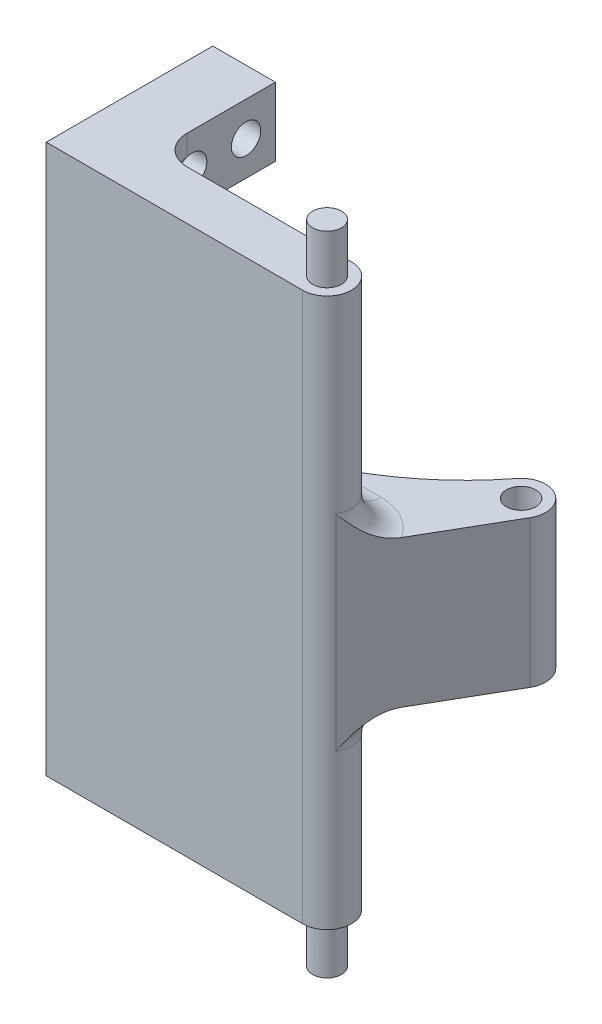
ISO-10303-21;
HEADER;
FILE_DESCRIPTION(('STEP AP214'),'2;1');
FILE_NAME('part.step','',(''),(''),'','','');
FILE_SCHEMA(('AUTOMOTIVE_DESIGN { 1 0 10303 214 1 1 1 1 }'));
ENDSEC;
DATA;
#1=APPLICATION_CONTEXT('core data for automotive mechanical design processes');
#2=APPLICATION_PROTOCOL_DEFINITION('international standard','automotive_design',2000,#1);
#3=PRODUCT_CONTEXT('',#1,'mechanical');
#4=PRODUCT('Part','Part','',(#3));
#5=PRODUCT_RELATED_PRODUCT_CATEGORY('part','',(#4));
#6=PRODUCT_DEFINITION_FORMATION('','',#4);
#7=PRODUCT_DEFINITION_CONTEXT('part definition',#1,'design');
#8=PRODUCT_DEFINITION('design','',#6,#7);
#9=PRODUCT_DEFINITION_SHAPE('','',#8);
#10=(LENGTH_UNIT() NAMED_UNIT(*) SI_UNIT(.MILLI.,.METRE.));
#11=(NAMED_UNIT(*) PLANE_ANGLE_UNIT() SI_UNIT($,.RADIAN.));
#12=(NAMED_UNIT(*) SI_UNIT($,.STERADIAN.) SOLID_ANGLE_UNIT());
#13=UNCERTAINTY_MEASURE_WITH_UNIT(LENGTH_MEASURE(1.E-05),#10,'distance_accuracy_value','');
#14=(GEOMETRIC_REPRESENTATION_CONTEXT(3) GLOBAL_UNCERTAINTY_ASSIGNED_CONTEXT((#13)) GLOBAL_UNIT_ASSIGNED_CONTEXT((#10,
#11,#12)) REPRESENTATION_CONTEXT('',''));
#15=CARTESIAN_POINT('',(0.,0.,0.));
#16=DIRECTION('',(0.,0.,1.));
#17=DIRECTION('',(1.,0.,0.));
#18=AXIS2_PLACEMENT_3D('',#15,#16,#17);
#19=CARTESIAN_POINT('',(22.27,28.,0.));
#20=DIRECTION('',(0.,-1.,0.));
#21=DIRECTION('',(0.,0.,-1.));
#22=AXIS2_PLACEMENT_3D('',#19,#20,#21);
#23=CYLINDRICAL_SURFACE('',#22,2.49999999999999);
#24=DIRECTION('',(0.,-1.,0.));
#25=VECTOR('',#24,1.);
#26=CARTESIAN_POINT('',(22.27,28.,-2.50000000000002));
#27=LINE('',#26,#25);
#28=CARTESIAN_POINT('',(22.27,-12.3,-2.50000000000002));
#29=VERTEX_POINT('',#28);
#30=CARTESIAN_POINT('',(22.27,-28.,-2.50000000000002));
#31=VERTEX_POINT('',#30);
#32=EDGE_CURVE('E359',#29,#31,#27,.T.);
#33=ORIENTED_EDGE('',*,*,#32,.F.);
#34=CARTESIAN_POINT('',(22.27,-12.3,0.));
#35=DIRECTION('',(0.,1.,0.));
#36=DIRECTION('',(0.,0.,1.));
#37=AXIS2_PLACEMENT_3D('',#34,#35,#36);
#38=CIRCLE('',#37,2.49999999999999);
#39=CARTESIAN_POINT('',(24.4341810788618,-12.3,1.25152717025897));
#40=VERTEX_POINT('',#39);
#41=EDGE_CURVE('E390',#29,#40,#38,.F.);
#42=ORIENTED_EDGE('',*,*,#41,.T.);
#43=DIRECTION('',(0.,1.,0.));
#44=VECTOR('',#43,1.);
#45=CARTESIAN_POINT('',(24.4341810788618,-9.3,1.25152717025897));
#46=LINE('',#45,#44);
#47=CARTESIAN_POINT('',(24.4341810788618,8.7,1.25152717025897));
#48=VERTEX_POINT('',#47);
#49=EDGE_CURVE('E242',#40,#48,#46,.T.);
#50=ORIENTED_EDGE('',*,*,#49,.T.);
#51=CARTESIAN_POINT('',(22.27,8.7,0.));
#52=DIRECTION('',(0.,1.,0.));
#53=DIRECTION('',(0.,0.,1.));
#54=AXIS2_PLACEMENT_3D('',#51,#52,#53);
#55=CIRCLE('',#54,2.49999999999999);
#56=CARTESIAN_POINT('',(22.27,8.7,-2.50000000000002));
#57=VERTEX_POINT('',#56);
#58=EDGE_CURVE('E387',#48,#57,#55,.T.);
#59=ORIENTED_EDGE('',*,*,#58,.T.);
#60=CARTESIAN_POINT('',(22.27,28.,-2.50000000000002));
#61=VERTEX_POINT('',#60);
#62=EDGE_CURVE('E366',#61,#57,#27,.T.);
#63=ORIENTED_EDGE('',*,*,#62,.F.);
#64=CARTESIAN_POINT('',(22.27,28.,0.));
#65=DIRECTION('',(0.,1.,0.));
#66=DIRECTION('',(0.,0.,1.));
#67=AXIS2_PLACEMENT_3D('',#64,#65,#66);
#68=CIRCLE('',#67,2.49999999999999);
#69=CARTESIAN_POINT('',(22.27,28.,2.5));
#70=VERTEX_POINT('',#69);
#71=EDGE_CURVE('E353',#70,#61,#68,.T.);
#72=ORIENTED_EDGE('',*,*,#71,.F.);
#73=DIRECTION('',(0.,-1.,0.));
#74=VECTOR('',#73,1.);
#75=CARTESIAN_POINT('',(22.27,28.,2.5));
#76=LINE('',#75,#74);
#77=CARTESIAN_POINT('',(22.27,-28.,2.5));
#78=VERTEX_POINT('',#77);
#79=EDGE_CURVE('E369',#70,#78,#76,.T.);
#80=ORIENTED_EDGE('',*,*,#79,.T.);
#81=CARTESIAN_POINT('',(22.27,-28.,0.));
#82=DIRECTION('',(0.,1.,0.));
#83=DIRECTION('',(0.,0.,1.));
#84=AXIS2_PLACEMENT_3D('',#81,#82,#83);
#85=CIRCLE('',#84,2.49999999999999);
#86=EDGE_CURVE('E362',#78,#31,#85,.T.);
#87=ORIENTED_EDGE('',*,*,#86,.T.);
#88=EDGE_LOOP('',(#33,#42,#50,#59,#63,#72,#80,#87));
#89=FACE_BOUND('',#88,.T.);
#90=ADVANCED_FACE('F60',(#89),#23,.T.);
#91=CARTESIAN_POINT('',(0.,28.,-2.5));
#92=DIRECTION('',(0.,0.,-1.));
#93=DIRECTION('',(-1.,0.,0.));
#94=AXIS2_PLACEMENT_3D('',#91,#92,#93);
#95=PLANE('',#94);
#96=DIRECTION('',(0.,-1.,0.));
#97=VECTOR('',#96,1.);
#98=CARTESIAN_POINT('',(3.85425667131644,-9.3,-2.50000000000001));
#99=LINE('',#98,#97);
#100=CARTESIAN_POINT('',(3.85425667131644,8.7,-2.50000000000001));
#101=VERTEX_POINT('',#100);
#102=CARTESIAN_POINT('',(3.85425667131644,-12.3,-2.50000000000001));
#103=VERTEX_POINT('',#102);
#104=EDGE_CURVE('E377',#101,#103,#99,.T.);
#105=ORIENTED_EDGE('',*,*,#104,.T.);
#106=DIRECTION('',(1.,0.,0.));
#107=VECTOR('',#106,1.);
#108=CARTESIAN_POINT('',(0.,-12.3,-2.5));
#109=LINE('',#108,#107);
#110=EDGE_CURVE('E506',#103,#29,#109,.T.);
#111=ORIENTED_EDGE('',*,*,#110,.T.);
#112=ORIENTED_EDGE('',*,*,#32,.T.);
#113=DIRECTION('',(1.,0.,0.));
#114=VECTOR('',#113,1.);
#115=CARTESIAN_POINT('',(0.,-28.,-2.5));
#116=LINE('',#115,#114);
#117=CARTESIAN_POINT('',(5.5,-28.,-2.50000000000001));
#118=VERTEX_POINT('',#117);
#119=EDGE_CURVE('E354',#118,#31,#116,.T.);
#120=ORIENTED_EDGE('',*,*,#119,.F.);
#121=DIRECTION('',(0.,-1.,0.));
#122=VECTOR('',#121,1.);
#123=CARTESIAN_POINT('',(5.5,-21.,-2.50000000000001));
#124=LINE('',#123,#122);
#125=CARTESIAN_POINT('',(5.49999999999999,-25.9142135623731,-2.50000000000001));
#126=VERTEX_POINT('',#125);
#127=EDGE_CURVE('E408',#118,#126,#124,.F.);
#128=ORIENTED_EDGE('',*,*,#127,.T.);
#129=CARTESIAN_POINT('',(5.41785978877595,-26.6395579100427,-2.50000000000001));
#130=CARTESIAN_POINT('',(2.33707020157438,-25.9227357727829,-2.5));
#131=CARTESIAN_POINT('',(2.49999999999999,-25.9606454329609,-5.65865718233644));
#132=CARTESIAN_POINT('',(5.42756827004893,-26.597837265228,-2.50000000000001));
#133=CARTESIAN_POINT('',(2.34336804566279,-25.9250910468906,-2.5));
#134=CARTESIAN_POINT('',(2.49999999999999,-25.9591665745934,-5.65234054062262));
#135=CARTESIAN_POINT('',(5.43640968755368,-26.5559156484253,-2.50000000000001));
#136=CARTESIAN_POINT('',(2.35013721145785,-25.9271362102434,-2.5));
#137=CARTESIAN_POINT('',(2.49999999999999,-25.9575654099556,-5.64566308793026));
#138=CARTESIAN_POINT('',(5.45236097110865,-26.4717471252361,-2.50000000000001));
#139=CARTESIAN_POINT('',(2.36471398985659,-25.930420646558,-2.5));
#140=CARTESIAN_POINT('',(2.49999999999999,-25.9540346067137,-5.63143626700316));
#141=CARTESIAN_POINT('',(5.45947095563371,-26.4295002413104,-2.50000000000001));
#142=CARTESIAN_POINT('',(2.37251680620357,-25.9316614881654,-2.5));
#143=CARTESIAN_POINT('',(2.49999999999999,-25.9521049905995,-5.62388695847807));
#144=CARTESIAN_POINT('',(5.47198812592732,-26.3445835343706,-2.50000000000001));
#145=CARTESIAN_POINT('',(2.3892913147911,-25.9331658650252,-2.5));
#146=CARTESIAN_POINT('',(2.49999999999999,-25.9478247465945,-5.6077332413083));
#147=CARTESIAN_POINT('',(5.47738842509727,-26.3019126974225,-2.50000000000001));
#148=CARTESIAN_POINT('',(2.39826153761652,-25.933428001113,-2.5));
#149=CARTESIAN_POINT('',(2.49999999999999,-25.9454724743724,-5.59912475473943));
#150=CARTESIAN_POINT('',(5.48646028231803,-26.2163868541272,-2.50000000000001));
#151=CARTESIAN_POINT('',(2.41746814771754,-25.9327322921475,-2.5));
#152=CARTESIAN_POINT('',(2.49999999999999,-25.9402294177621,-5.58067734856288));
#153=CARTESIAN_POINT('',(5.49013179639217,-26.173531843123,-2.50000000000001));
#154=CARTESIAN_POINT('',(2.42769666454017,-25.9317784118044,-2.5));
#155=CARTESIAN_POINT('',(2.49999999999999,-25.9373386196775,-5.57083839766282));
#156=CARTESIAN_POINT('',(5.49574290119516,-26.0880782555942,-2.50000000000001));
#157=CARTESIAN_POINT('',(2.44946712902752,-25.9283760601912,-2.5));
#158=CARTESIAN_POINT('',(2.49999999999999,-25.9308799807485,-5.54977428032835));
#159=CARTESIAN_POINT('',(5.49769707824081,-26.0454806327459,-2.50000000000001));
#160=CARTESIAN_POINT('',(2.46098663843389,-25.9259466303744,-2.5));
#161=CARTESIAN_POINT('',(2.49999999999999,-25.9273181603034,-5.53856172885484));
#162=CARTESIAN_POINT('',(5.49995859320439,-25.9602443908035,-2.50000000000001));
#163=CARTESIAN_POINT('',(2.48556949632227,-25.9192419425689,-2.5));
#164=CARTESIAN_POINT('',(2.49999999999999,-25.9192734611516,-5.51438170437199));
#165=CARTESIAN_POINT('',(5.50026601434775,-25.9176057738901,-2.50000000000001));
#166=CARTESIAN_POINT('',(2.49861958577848,-25.9149761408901,-2.5));
#167=CARTESIAN_POINT('',(2.49999999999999,-25.9147906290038,-5.50141432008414));
#168=CARTESIAN_POINT('',(5.49928043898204,-25.8324502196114,-2.50000000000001));
#169=CARTESIAN_POINT('',(2.52641909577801,-25.9041459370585,-2.5));
#170=CARTESIAN_POINT('',(2.49999999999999,-25.9045963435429,-5.47337492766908));
#171=CARTESIAN_POINT('',(5.49799129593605,-25.7899332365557,-2.50000000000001));
#172=CARTESIAN_POINT('',(2.54114687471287,-25.8976014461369,-2.5));
#173=CARTESIAN_POINT('',(2.49999999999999,-25.8988878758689,-5.45830806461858));
#174=CARTESIAN_POINT('',(5.4938833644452,-25.7049683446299,-2.50000000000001));
#175=CARTESIAN_POINT('',(2.57254361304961,-25.8815842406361,-2.5));
#176=CARTESIAN_POINT('',(2.49999999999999,-25.8857566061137,-5.4255579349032));
#177=CARTESIAN_POINT('',(5.49106433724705,-25.6625204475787,-2.50000000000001));
#178=CARTESIAN_POINT('',(2.58918987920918,-25.8721331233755,-2.5));
#179=CARTESIAN_POINT('',(2.49999999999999,-25.8783335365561,-5.4078742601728));
#180=CARTESIAN_POINT('',(5.48223183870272,-25.5568398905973,-2.50000000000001));
#181=CARTESIAN_POINT('',(2.63333801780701,-25.8439975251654,-2.5));
#182=CARTESIAN_POINT('',(2.49999999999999,-25.8568927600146,-5.35978040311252));
#183=CARTESIAN_POINT('',(5.47532861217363,-25.4936801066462,-2.50000000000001));
#184=CARTESIAN_POINT('',(2.66216032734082,-25.8230886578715,-2.5));
#185=CARTESIAN_POINT('',(2.49999999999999,-25.8414281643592,-5.32739468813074));
#186=CARTESIAN_POINT('',(5.46289602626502,-25.3992399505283,-2.50000000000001));
#187=CARTESIAN_POINT('',(2.70977915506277,-25.7823456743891,-2.5));
#188=CARTESIAN_POINT('',(2.49999999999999,-25.8113734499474,-5.27148857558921));
#189=CARTESIAN_POINT('',(5.45840661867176,-25.3678159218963,-2.50000000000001));
#190=CARTESIAN_POINT('',(2.72628149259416,-25.767304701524,-2.5));
#191=CARTESIAN_POINT('',(2.49999999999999,-25.8002150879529,-5.25163653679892));
#192=CARTESIAN_POINT('',(5.44882220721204,-25.3050602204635,-2.50000000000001));
#193=CARTESIAN_POINT('',(2.76075290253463,-25.7334157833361,-2.5));
#194=CARTESIAN_POINT('',(2.49999999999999,-25.774790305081,-5.20909505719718));
#195=CARTESIAN_POINT('',(5.443727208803,-25.2737285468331,-2.50000000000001));
#196=CARTESIAN_POINT('',(2.77869870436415,-25.714606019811,-2.5));
#197=CARTESIAN_POINT('',(2.49999999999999,-25.7605239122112,-5.18640564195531));
#198=CARTESIAN_POINT('',(5.43304753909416,-25.211182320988,-2.50000000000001));
#199=CARTESIAN_POINT('',(2.81604166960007,-25.6723187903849,-2.5));
#200=CARTESIAN_POINT('',(2.49999999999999,-25.7278194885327,-5.13784165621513));
#201=CARTESIAN_POINT('',(5.42746336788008,-25.1799676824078,-2.50000000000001));
#202=CARTESIAN_POINT('',(2.83541029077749,-25.6488984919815,-2.5));
#203=CARTESIAN_POINT('',(2.49999999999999,-25.7093856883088,-5.11197032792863));
#204=CARTESIAN_POINT('',(5.41595104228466,-25.1176026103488,-2.50000000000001));
#205=CARTESIAN_POINT('',(2.8754983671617,-25.5962732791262,-2.50000000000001));
#206=CARTESIAN_POINT('',(2.49999999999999,-25.6668312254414,-5.05674783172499));
#207=CARTESIAN_POINT('',(5.41002288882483,-25.086452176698,-2.50000000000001));
#208=CARTESIAN_POINT('',(2.89618867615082,-25.5671387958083,-2.5));
#209=CARTESIAN_POINT('',(2.49999999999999,-25.6427105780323,-5.02739667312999));
#210=CARTESIAN_POINT('',(5.39801558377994,-25.0241209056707,-2.50000000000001));
#211=CARTESIAN_POINT('',(2.93862207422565,-25.5017015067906,-2.5));
#212=CARTESIAN_POINT('',(2.49999999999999,-25.5866884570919,-4.96517214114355));
#213=CARTESIAN_POINT('',(5.39193617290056,-24.9929401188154,-2.50000000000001));
#214=CARTESIAN_POINT('',(2.96034006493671,-25.4654761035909,-2.5));
#215=CARTESIAN_POINT('',(2.49999999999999,-25.5547726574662,-4.932292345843));
#216=CARTESIAN_POINT('',(5.3799175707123,-24.9305495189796,-2.50000000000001));
#217=CARTESIAN_POINT('',(3.00406946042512,-25.3844249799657,-2.5));
#218=CARTESIAN_POINT('',(2.49999999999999,-25.4805587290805,-4.86375072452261));
#219=CARTESIAN_POINT('',(5.37397838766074,-24.8993397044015,-2.50000000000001));
#220=CARTESIAN_POINT('',(3.02606439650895,-25.3397052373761,-2.5));
#221=CARTESIAN_POINT('',(2.49999999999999,-25.4382599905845,-4.8280887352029));
#222=CARTESIAN_POINT('',(5.36245742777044,-24.8359353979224,-2.50000000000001));
#223=CARTESIAN_POINT('',(3.06963746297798,-25.2388905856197,-2.5));
#224=CARTESIAN_POINT('',(2.49999999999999,-25.3388819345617,-4.75493605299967));
#225=CARTESIAN_POINT('',(5.35689056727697,-24.8037380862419,-2.50000000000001));
#226=CARTESIAN_POINT('',(3.09120117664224,-25.1826015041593,-2.5));
#227=CARTESIAN_POINT('',(2.49999999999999,-25.2814173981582,-4.71742218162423));
#228=CARTESIAN_POINT('',(5.34934843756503,-24.7553140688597,-2.50000000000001));
#229=CARTESIAN_POINT('',(3.12106019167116,-25.0896551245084,-2.5));
#230=CARTESIAN_POINT('',(2.49999999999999,-25.1828299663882,-4.66391319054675));
#231=CARTESIAN_POINT('',(5.34696903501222,-24.7391509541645,-2.50000000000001));
#232=CARTESIAN_POINT('',(3.13057423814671,-25.0573686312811,-2.5));
#233=CARTESIAN_POINT('',(2.49999999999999,-25.1479012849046,-4.6465367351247));
#234=CARTESIAN_POINT('',(5.34255426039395,-24.7067781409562,-2.50000000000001));
#235=CARTESIAN_POINT('',(3.14838394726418,-24.9901687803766,-2.5));
#236=CARTESIAN_POINT('',(2.49999999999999,-25.0739100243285,-4.61354043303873));
#237=CARTESIAN_POINT('',(5.34051887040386,-24.690568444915,-2.50000000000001));
#238=CARTESIAN_POINT('',(3.15668910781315,-24.9552506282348,-2.5));
#239=CARTESIAN_POINT('',(2.49999999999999,-25.0348476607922,-4.59792049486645));
#240=CARTESIAN_POINT('',(5.33687218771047,-24.658168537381,-2.50000000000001));
#241=CARTESIAN_POINT('',(3.1716768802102,-24.8832014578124,-2.5));
#242=CARTESIAN_POINT('',(2.49999999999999,-24.9530156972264,-4.5693906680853));
#243=CARTESIAN_POINT('',(5.33525918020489,-24.6419785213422,-2.50000000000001));
#244=CARTESIAN_POINT('',(3.17837682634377,-24.8460643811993,-2.5));
#245=CARTESIAN_POINT('',(2.49999999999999,-24.9102620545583,-4.55646986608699));
#246=CARTESIAN_POINT('',(5.33251196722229,-24.6095575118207,-2.50000000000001));
#247=CARTESIAN_POINT('',(3.18984301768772,-24.7699134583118,-2.5));
#248=CARTESIAN_POINT('',(2.49999999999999,-24.8215500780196,-4.534157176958));
#249=CARTESIAN_POINT('',(5.33137775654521,-24.593326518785,-2.50000000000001));
#250=CARTESIAN_POINT('',(3.19461989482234,-24.7308705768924,-2.5));
#251=CARTESIAN_POINT('',(2.49999999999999,-24.77559177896,-4.52476525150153));
#252=CARTESIAN_POINT('',(5.32963948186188,-24.5608404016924,-2.50000000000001));
#253=CARTESIAN_POINT('',(3.20195591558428,-24.6515679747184,-2.5));
#254=CARTESIAN_POINT('',(2.49999999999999,-24.681508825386,-4.51026273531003));
#255=CARTESIAN_POINT('',(5.32903526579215,-24.5445852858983,-2.50000000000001));
#256=CARTESIAN_POINT('',(3.20452367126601,-24.6112681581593,-2.5));
#257=CARTESIAN_POINT('',(2.49999999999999,-24.6333847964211,-4.50515091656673));
#258=CARTESIAN_POINT('',(5.32838557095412,-24.5120637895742,-2.50000000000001));
#259=CARTESIAN_POINT('',(3.20728209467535,-24.5302292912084,-2.5));
#260=CARTESIAN_POINT('',(2.49999999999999,-24.5362903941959,-4.49965120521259));
#261=CARTESIAN_POINT('',(5.32834008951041,-24.4957974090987,-2.50000000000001));
#262=CARTESIAN_POINT('',(3.20747603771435,-24.4894426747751,-2.50000000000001));
#263=CARTESIAN_POINT('',(2.49999999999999,-24.4873200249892,-4.49926328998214));
#264=CARTESIAN_POINT('',(5.32881053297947,-24.4632436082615,-2.50000000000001));
#265=CARTESIAN_POINT('',(3.20547775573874,-24.4081975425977,-2.50000000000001));
#266=CARTESIAN_POINT('',(2.49999999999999,-24.3899059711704,-4.50325000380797));
#267=CARTESIAN_POINT('',(5.32932746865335,-24.4469562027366,-2.50000000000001));
#268=CARTESIAN_POINT('',(3.20327884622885,-24.3676914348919,-2.5));
#269=CARTESIAN_POINT('',(2.49999999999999,-24.3414633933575,-4.507633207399));
#270=CARTESIAN_POINT('',(5.33089916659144,-24.4144076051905,-2.50000000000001));
#271=CARTESIAN_POINT('',(3.19663709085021,-24.2878764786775,-2.5));
#272=CARTESIAN_POINT('',(2.49999999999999,-24.2465682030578,-4.52078774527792));
#273=CARTESIAN_POINT('',(5.33195393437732,-24.3981464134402,-2.50000000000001));
#274=CARTESIAN_POINT('',(3.19218683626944,-24.2485254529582,-2.5));
#275=CARTESIAN_POINT('',(2.49999999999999,-24.2001156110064,-4.5295591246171));
#276=CARTESIAN_POINT('',(5.3345533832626,-24.3656582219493,-2.50000000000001));
#277=CARTESIAN_POINT('',(3.18131509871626,-24.1716649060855,-2.5));
#278=CARTESIAN_POINT('',(2.49999999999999,-24.1102733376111,-4.55077709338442));
#279=CARTESIAN_POINT('',(5.33609823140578,-24.349431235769,-2.50000000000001));
#280=CARTESIAN_POINT('',(3.1748825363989,-24.1341248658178,-2.5));
#281=CARTESIAN_POINT('',(2.49999999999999,-24.0668847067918,-4.56322493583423));
#282=CARTESIAN_POINT('',(5.33961358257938,-24.3170239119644,-2.50000000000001));
#283=CARTESIAN_POINT('',(3.16039607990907,-24.0613706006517,-2.5));
#284=CARTESIAN_POINT('',(2.49999999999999,-23.9838902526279,-4.59090580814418));
#285=CARTESIAN_POINT('',(5.34158408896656,-24.3008435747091,-2.50000000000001));
#286=CARTESIAN_POINT('',(3.15233113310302,-24.0261380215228,-2.5));
#287=CARTESIAN_POINT('',(2.49999999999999,-23.9442844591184,-4.60613885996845));
#288=CARTESIAN_POINT('',(5.34588792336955,-24.2684607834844,-2.50000000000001));
#289=CARTESIAN_POINT('',(3.1349160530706,-23.9581308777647,-2.5));
#290=CARTESIAN_POINT('',(2.49999999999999,-23.8690148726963,-4.63854961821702));
#291=CARTESIAN_POINT('',(5.34822277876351,-24.2522585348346,-2.50000000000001));
#292=CARTESIAN_POINT('',(3.1255509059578,-23.9253616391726,-2.5));
#293=CARTESIAN_POINT('',(2.49999999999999,-23.8333688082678,-4.65573542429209));
#294=CARTESIAN_POINT('',(5.35317566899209,-24.2198971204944,-2.50000000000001));
#295=CARTESIAN_POINT('',(3.10591744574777,-23.8625557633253,-2.5));
#296=CARTESIAN_POINT('',(2.49999999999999,-23.7662172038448,-4.69118322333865));
#297=CARTESIAN_POINT('',(5.35579371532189,-24.2037379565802,-2.50000000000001));
#298=CARTESIAN_POINT('',(3.09564180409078,-23.8325220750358,-2.5));
#299=CARTESIAN_POINT('',(2.49999999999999,-23.7347118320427,-4.70944525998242));
#300=CARTESIAN_POINT('',(5.36396412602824,-24.1553185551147,-2.50000000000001));
#301=CARTESIAN_POINT('',(3.06388289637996,-23.7463142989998,-2.5));
#302=CARTESIAN_POINT('',(2.49999999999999,-23.6461198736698,-4.76478043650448));
#303=CARTESIAN_POINT('',(5.36983333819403,-24.1231123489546,-2.50000000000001));
#304=CARTESIAN_POINT('',(3.04159489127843,-23.6945044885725,-2.5));
#305=CARTESIAN_POINT('',(2.49999999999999,-23.5949480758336,-4.80240707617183));
#306=CARTESIAN_POINT('',(5.38184492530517,-24.0592334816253,-2.50000000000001));
#307=CARTESIAN_POINT('',(2.99696329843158,-23.6013460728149,-2.5));
#308=CARTESIAN_POINT('',(2.49999999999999,-23.5060727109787,-4.87512037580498));
#309=CARTESIAN_POINT('',(5.38798214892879,-24.0275598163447,-2.50000000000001));
#310=CARTESIAN_POINT('',(2.97462690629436,-23.5599643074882,-2.5));
#311=CARTESIAN_POINT('',(2.49999999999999,-23.4681857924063,-4.91023581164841));
#312=CARTESIAN_POINT('',(5.40025892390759,-23.9642134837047,-2.50000000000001));
#313=CARTESIAN_POINT('',(2.93060971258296,-23.4851670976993,-2.5));
#314=CARTESIAN_POINT('',(2.49999999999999,-23.401821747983,-4.9771515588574));
#315=CARTESIAN_POINT('',(5.40639847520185,-23.9325408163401,-2.50000000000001));
#316=CARTESIAN_POINT('',(2.90895284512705,-23.451857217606,-2.5));
#317=CARTESIAN_POINT('',(2.49999999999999,-23.3733443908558,-5.00895195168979));
#318=CARTESIAN_POINT('',(5.4184133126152,-23.8692093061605,-2.50000000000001));
#319=CARTESIAN_POINT('',(2.86687241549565,-23.391816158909,-2.5));
#320=CARTESIAN_POINT('',(2.49999999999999,-23.3233710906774,-5.06884086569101));
#321=CARTESIAN_POINT('',(5.42428909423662,-23.8375505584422,-2.50000000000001));
#322=CARTESIAN_POINT('',(2.84647644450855,-23.3651567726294,-2.5));
#323=CARTESIAN_POINT('',(2.49999999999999,-23.3018615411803,-5.09693655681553));
#324=CARTESIAN_POINT('',(5.43560506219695,-23.7741546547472,-2.50000000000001));
#325=CARTESIAN_POINT('',(2.80709781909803,-23.3170944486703,-2.5));
#326=CARTESIAN_POINT('',(2.49999999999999,-23.2638911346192,-5.14965534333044));
#327=CARTESIAN_POINT('',(5.44104524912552,-23.7424174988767,-2.50000000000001));
#328=CARTESIAN_POINT('',(2.78814487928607,-23.2957555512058,-2.5));
#329=CARTESIAN_POINT('',(2.49999999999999,-23.2474302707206,-5.17427844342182));
#330=CARTESIAN_POINT('',(5.45133937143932,-23.6789440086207,-2.50000000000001));
#331=CARTESIAN_POINT('',(2.75176287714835,-23.2573827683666,-2.5));
#332=CARTESIAN_POINT('',(2.49999999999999,-23.2182544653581,-5.22034117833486));
#333=CARTESIAN_POINT('',(5.45619499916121,-23.6472079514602,-2.50000000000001));
#334=CARTESIAN_POINT('',(2.7343551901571,-23.2403822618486,-2.5));
#335=CARTESIAN_POINT('',(2.49999999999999,-23.2055285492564,-5.241790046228));
#336=CARTESIAN_POINT('',(5.46523987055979,-23.5836410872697,-2.50000000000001));
#337=CARTESIAN_POINT('',(2.70096771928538,-23.209815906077,-2.5));
#338=CARTESIAN_POINT('',(2.49999999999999,-23.1828114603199,-5.28198771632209));
#339=CARTESIAN_POINT('',(5.46942910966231,-23.5518102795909,-2.50000000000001));
#340=CARTESIAN_POINT('',(2.68500990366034,-23.1962834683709,-2.5));
#341=CARTESIAN_POINT('',(2.49999999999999,-23.1728203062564,-5.30073649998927));
#342=CARTESIAN_POINT('',(5.48088469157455,-23.4561431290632,-2.50000000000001));
#343=CARTESIAN_POINT('',(2.63901259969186,-23.1597298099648,-2.5));
#344=CARTESIAN_POINT('',(2.49999999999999,-23.1458644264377,-5.35354088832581));
#345=CARTESIAN_POINT('',(5.48703303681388,-23.3921670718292,-2.50000000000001));
#346=CARTESIAN_POINT('',(2.61123084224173,-23.1411146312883,-2.5));
#347=CARTESIAN_POINT('',(2.49999999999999,-23.1319316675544,-5.38412999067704));
#348=CARTESIAN_POINT('',(5.49596515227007,-23.2635791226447,-2.50000000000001));
#349=CARTESIAN_POINT('',(2.56007980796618,-23.1112306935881,-2.5));
#350=CARTESIAN_POINT('',(2.49999999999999,-23.1086425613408,-5.43876802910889));
#351=CARTESIAN_POINT('',(5.49872786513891,-23.1989657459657,-2.50000000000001));
#352=CARTESIAN_POINT('',(2.53683537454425,-23.1001075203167,-2.5));
#353=CARTESIAN_POINT('',(2.49999999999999,-23.0993150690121,-5.46277531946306));
#354=CARTESIAN_POINT('',(5.50057654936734,-23.0696993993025,-2.50000000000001));
#355=CARTESIAN_POINT('',(2.49425516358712,-23.083153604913,-2.5));
#356=CARTESIAN_POINT('',(2.49999999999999,-23.0835597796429,-5.50581502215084));
#357=CARTESIAN_POINT('',(5.49966346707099,-23.0050464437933,-2.50000000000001));
#358=CARTESIAN_POINT('',(2.4749800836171,-23.0773728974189,-2.5));
#359=CARTESIAN_POINT('',(2.49999999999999,-23.0771312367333,-5.52484871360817));
#360=CARTESIAN_POINT('',(5.49394404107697,-22.8743696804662,-2.50000000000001));
#361=CARTESIAN_POINT('',(2.43929972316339,-23.069473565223,-2.5));
#362=CARTESIAN_POINT('',(2.49999999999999,-23.0659719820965,-5.5596508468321));
#363=CARTESIAN_POINT('',(5.48904568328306,-22.8083498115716,-2.50000000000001));
#364=CARTESIAN_POINT('',(2.42301888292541,-23.0674740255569,-2.5));
#365=CARTESIAN_POINT('',(2.49999999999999,-23.0612852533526,-5.57533093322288));
#366=CARTESIAN_POINT('',(5.47515751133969,-22.676700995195,-2.50000000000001));
#367=CARTESIAN_POINT('',(2.39342201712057,-23.0663920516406,-2.5));
#368=CARTESIAN_POINT('',(2.49999999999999,-23.053218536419,-5.60374788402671));
#369=CARTESIAN_POINT('',(5.46616513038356,-22.611072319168,-2.50000000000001));
#370=CARTESIAN_POINT('',(2.38013706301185,-23.0673263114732,-2.5));
#371=CARTESIAN_POINT('',(2.49999999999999,-23.049839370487,-5.61648289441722));
#372=CARTESIAN_POINT('',(5.45508807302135,-22.5457905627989,-2.50000000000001));
#373=CARTESIAN_POINT('',(2.36809258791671,-23.0691755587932,-2.5));
#374=CARTESIAN_POINT('',(2.49999999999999,-23.0468113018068,-5.62819009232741));
#375=(BOUNDED_SURFACE() B_SPLINE_SURFACE(3,2,((#129,#130,#131),(#132,#133,#134),(#135,#136,
#137),(#138,#139,#140),(#141,#142,#143),(#144,#145,#146),(#147,#148,#149),(#150,#151,#152),
(#153,#154,#155),(#156,#157,#158),(#159,#160,#161),(#162,#163,#164),(#165,#166,#167),(#168,#169,
#170),(#171,#172,#173),(#174,#175,#176),(#177,#178,#179),(#180,#181,#182),(#183,#184,#185),
(#186,#187,#188),(#189,#190,#191),(#192,#193,#194),(#195,#196,#197),(#198,#199,#200),(#201,#202,
#203),(#204,#205,#206),(#207,#208,#209),(#210,#211,#212),(#213,#214,#215),(#216,#217,#218),
(#219,#220,#221),(#222,#223,#224),(#225,#226,#227),(#228,#229,#230),(#231,#232,#233),(#234,#235,
#236),(#237,#238,#239),(#240,#241,#242),(#243,#244,#245),(#246,#247,#248),(#249,#250,#251),
(#252,#253,#254),(#255,#256,#257),(#258,#259,#260),(#261,#262,#263),(#264,#265,#266),(#267,#268,
#269),(#270,#271,#272),(#273,#274,#275),(#276,#277,#278),(#279,#280,#281),(#282,#283,#284),
(#285,#286,#287),(#288,#289,#290),(#291,#292,#293),(#294,#295,#296),(#297,#298,#299),(#300,#301,
#302),(#303,#304,#305),(#306,#307,#308),(#309,#310,#311),(#312,#313,#314),(#315,#316,#317),
(#318,#319,#320),(#321,#322,#323),(#324,#325,#326),(#327,#328,#329),(#330,#331,#332),(#333,#334,
#335),(#336,#337,#338),(#339,#340,#341),(#342,#343,#344),(#345,#346,#347),(#348,#349,#350),
(#351,#352,#353),(#354,#355,#356),(#357,#358,#359),(#360,#361,#362),(#363,#364,#365),(#366,#367,
#368),(#369,#370,#371),(#372,#373,#374)),.UNSPECIFIED.,.F.,.F.,
.F.) B_SPLINE_SURFACE_WITH_KNOTS((4,2,2,2,2,2,2,2,2,2,2,2,2,2,2,2,2,2,2,2,2,2,2,2,2,2,2,2,2,2,2,
2,2,2,2,2,2,2,2,2,4),(3,3),(0.,0.128495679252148,0.256982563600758,0.385980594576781,
0.514981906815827,0.642876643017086,0.770764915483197,0.898345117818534,1.02594523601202,
1.21646943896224,1.31169437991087,1.40691846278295,1.50204630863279,1.59717389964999,
1.6924776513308,1.78778700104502,1.88579980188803,1.9348088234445,1.98381529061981,
2.03261960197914,2.08142338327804,2.13021315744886,2.17900269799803,2.22788006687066,
2.27675793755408,2.32565248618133,2.37454742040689,2.42365312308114,2.47276081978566,
2.57096391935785,2.66775273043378,2.76453916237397,2.86113543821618,2.957731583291,
3.05404098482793,3.15035104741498,3.34307757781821,3.53699680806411,3.73086611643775,
3.929343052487,4.12794459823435),(0.,1.),
.UNSPECIFIED.) GEOMETRIC_REPRESENTATION_ITEM() RATIONAL_B_SPLINE_SURFACE(((1.,0.688154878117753,
1.),(1.,0.688919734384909,1.),(1.,0.689727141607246,1.),(1.,0.691443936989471,1.),(1.,
0.692353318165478,1.),(1.,0.694294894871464,1.),(1.,0.695327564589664,1.),(1.,0.697534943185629,
1.),(1.,0.69870965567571,1.),(1.,0.701217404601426,1.),(1.,0.702548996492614,1.),(1.,
0.705411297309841,1.),(1.,0.706941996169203,1.),(1.,0.710239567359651,1.),(1.,0.712005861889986,
1.),(1.,0.715828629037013,1.),(1.,0.717885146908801,1.),(1.,0.723450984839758,1.),(1.,
0.727176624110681,1.),(1.,0.733545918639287,1.),(1.,0.735798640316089,1.),(1.,0.740601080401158,
1.),(1.,0.74315079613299,1.),(1.,0.748576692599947,1.),(1.,0.751452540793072,1.),(1.,
0.75755174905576,1.),(1.,0.760775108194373,1.),(1.,0.767560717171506,1.),(1.,0.771123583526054,
1.),(1.,0.77849539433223,1.),(1.,0.782304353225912,1.),(1.,0.790058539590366,1.),(1.,
0.794004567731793,1.),(1.,0.799594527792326,1.),(1.,0.801403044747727,1.),(1.,0.804826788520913,
1.),(1.,0.80644202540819,1.),(1.,0.80938478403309,1.),(1.,0.810713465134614,1.),(1.,
0.813003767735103,1.),(1.,0.813965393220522,1.),(1.,0.815448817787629,1.),(1.,0.815970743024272,
1.),(1.,0.816532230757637,1.),(1.,0.81657179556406,1.),(1.,0.816164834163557,1.),(1.,
0.815717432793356,1.),(1.,0.814372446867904,1.),(1.,0.81347485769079,1.),(1.,0.811298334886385,
1.),(1.,0.810019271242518,1.),(1.,0.807166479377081,1.),(1.,0.80559274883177,1.),(1.,
0.802233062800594,1.),(1.,0.800446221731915,1.),(1.,0.796747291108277,1.),(1.,0.794835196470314,
1.),(1.,0.789019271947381,1.),(1.,0.7850353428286,1.),(1.,0.777278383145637,1.),(1.,
0.773503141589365,1.),(1.,0.766260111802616,1.),(1.,0.762792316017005,1.),(1.,0.756221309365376,
1.),(1.,0.753117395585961,1.),(1.,0.747261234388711,1.),(1.,0.744508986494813,1.),(1.,
0.739335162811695,1.),(1.,0.736912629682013,1.),(1.,0.732352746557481,1.),(1.,0.730215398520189,
1.),(1.,0.724172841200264,1.),(1.,0.720639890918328,1.),(1.,0.714293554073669,1.),(1.,
0.711484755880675,1.),(1.,0.70642563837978,1.),(1.,0.704175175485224,1.),(1.,0.700044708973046,
1.),(1.,0.69817478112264,1.),(1.,0.694774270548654,1.),(1.,0.693243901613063,1.),(1.,
0.691834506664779,1.))) REPRESENTATION_ITEM('') SURFACE());
#376=CARTESIAN_POINT('',(5.41785978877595,-26.6395579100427,-2.50000000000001));
#377=CARTESIAN_POINT('',(5.42756827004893,-26.597837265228,-2.50000000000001));
#378=CARTESIAN_POINT('',(5.43640968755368,-26.5559156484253,-2.50000000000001));
#379=CARTESIAN_POINT('',(5.45236097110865,-26.4717471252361,-2.50000000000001));
#380=CARTESIAN_POINT('',(5.45947095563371,-26.4295002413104,-2.50000000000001));
#381=CARTESIAN_POINT('',(5.47198812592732,-26.3445835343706,-2.50000000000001));
#382=CARTESIAN_POINT('',(5.47738842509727,-26.3019126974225,-2.50000000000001));
#383=CARTESIAN_POINT('',(5.48646028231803,-26.2163868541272,-2.50000000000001));
#384=CARTESIAN_POINT('',(5.49013179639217,-26.173531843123,-2.50000000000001));
#385=CARTESIAN_POINT('',(5.49574290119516,-26.0880782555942,-2.50000000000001));
#386=CARTESIAN_POINT('',(5.49769707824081,-26.0454806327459,-2.50000000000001));
#387=CARTESIAN_POINT('',(5.49995859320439,-25.9602443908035,-2.50000000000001));
#388=CARTESIAN_POINT('',(5.50026601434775,-25.9176057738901,-2.50000000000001));
#389=CARTESIAN_POINT('',(5.49928043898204,-25.8324502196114,-2.50000000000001));
#390=CARTESIAN_POINT('',(5.49799129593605,-25.7899332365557,-2.50000000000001));
#391=CARTESIAN_POINT('',(5.4938833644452,-25.7049683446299,-2.50000000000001));
#392=CARTESIAN_POINT('',(5.49106433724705,-25.6625204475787,-2.50000000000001));
#393=CARTESIAN_POINT('',(5.48223183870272,-25.5568398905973,-2.50000000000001));
#394=CARTESIAN_POINT('',(5.47532861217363,-25.4936801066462,-2.50000000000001));
#395=CARTESIAN_POINT('',(5.46289602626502,-25.3992399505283,-2.50000000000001));
#396=CARTESIAN_POINT('',(5.45840661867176,-25.3678159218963,-2.50000000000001));
#397=CARTESIAN_POINT('',(5.44882220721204,-25.3050602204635,-2.50000000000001));
#398=CARTESIAN_POINT('',(5.443727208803,-25.2737285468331,-2.50000000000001));
#399=CARTESIAN_POINT('',(5.43304753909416,-25.211182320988,-2.50000000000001));
#400=CARTESIAN_POINT('',(5.42746336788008,-25.1799676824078,-2.50000000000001));
#401=CARTESIAN_POINT('',(5.41595104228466,-25.1176026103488,-2.50000000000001));
#402=CARTESIAN_POINT('',(5.41002288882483,-25.086452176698,-2.50000000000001));
#403=CARTESIAN_POINT('',(5.39801558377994,-25.0241209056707,-2.50000000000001));
#404=CARTESIAN_POINT('',(5.39193617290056,-24.9929401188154,-2.50000000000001));
#405=CARTESIAN_POINT('',(5.3799175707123,-24.9305495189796,-2.50000000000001));
#406=CARTESIAN_POINT('',(5.37397838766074,-24.8993397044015,-2.50000000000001));
#407=CARTESIAN_POINT('',(5.36245742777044,-24.8359353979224,-2.50000000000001));
#408=CARTESIAN_POINT('',(5.35689056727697,-24.8037380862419,-2.50000000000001));
#409=CARTESIAN_POINT('',(5.34934843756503,-24.7553140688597,-2.50000000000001));
#410=CARTESIAN_POINT('',(5.34696903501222,-24.7391509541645,-2.50000000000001));
#411=CARTESIAN_POINT('',(5.34255426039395,-24.7067781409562,-2.50000000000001));
#412=CARTESIAN_POINT('',(5.34051887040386,-24.690568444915,-2.50000000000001));
#413=CARTESIAN_POINT('',(5.33687218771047,-24.658168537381,-2.50000000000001));
#414=CARTESIAN_POINT('',(5.33525918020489,-24.6419785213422,-2.50000000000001));
#415=CARTESIAN_POINT('',(5.33251196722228,-24.6095575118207,-2.50000000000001));
#416=CARTESIAN_POINT('',(5.33137775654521,-24.593326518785,-2.50000000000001));
#417=CARTESIAN_POINT('',(5.32963948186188,-24.5608404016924,-2.50000000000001));
#418=CARTESIAN_POINT('',(5.32903526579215,-24.5445852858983,-2.50000000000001));
#419=CARTESIAN_POINT('',(5.32838557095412,-24.5120637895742,-2.50000000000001));
#420=CARTESIAN_POINT('',(5.32834008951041,-24.4957974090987,-2.50000000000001));
#421=CARTESIAN_POINT('',(5.32881053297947,-24.4632436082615,-2.50000000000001));
#422=CARTESIAN_POINT('',(5.32932746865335,-24.4469562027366,-2.50000000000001));
#423=CARTESIAN_POINT('',(5.33089916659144,-24.4144076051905,-2.50000000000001));
#424=CARTESIAN_POINT('',(5.33195393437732,-24.3981464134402,-2.50000000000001));
#425=CARTESIAN_POINT('',(5.3345533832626,-24.3656582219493,-2.50000000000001));
#426=CARTESIAN_POINT('',(5.33609823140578,-24.349431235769,-2.50000000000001));
#427=CARTESIAN_POINT('',(5.33961358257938,-24.3170239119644,-2.50000000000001));
#428=CARTESIAN_POINT('',(5.34158408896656,-24.3008435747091,-2.50000000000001));
#429=CARTESIAN_POINT('',(5.34588792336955,-24.2684607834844,-2.50000000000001));
#430=CARTESIAN_POINT('',(5.34822277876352,-24.2522585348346,-2.50000000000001));
#431=CARTESIAN_POINT('',(5.35317566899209,-24.2198971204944,-2.50000000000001));
#432=CARTESIAN_POINT('',(5.35579371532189,-24.2037379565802,-2.50000000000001));
#433=CARTESIAN_POINT('',(5.36396412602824,-24.1553185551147,-2.50000000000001));
#434=CARTESIAN_POINT('',(5.36983333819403,-24.1231123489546,-2.50000000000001));
#435=CARTESIAN_POINT('',(5.38184492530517,-24.0592334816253,-2.50000000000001));
#436=CARTESIAN_POINT('',(5.38798214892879,-24.0275598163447,-2.50000000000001));
#437=CARTESIAN_POINT('',(5.40025892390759,-23.9642134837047,-2.50000000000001));
#438=CARTESIAN_POINT('',(5.40639847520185,-23.9325408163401,-2.50000000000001));
#439=CARTESIAN_POINT('',(5.4184133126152,-23.8692093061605,-2.50000000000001));
#440=CARTESIAN_POINT('',(5.42428909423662,-23.8375505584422,-2.50000000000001));
#441=CARTESIAN_POINT('',(5.43560506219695,-23.7741546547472,-2.50000000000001));
#442=CARTESIAN_POINT('',(5.44104524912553,-23.7424174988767,-2.50000000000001));
#443=CARTESIAN_POINT('',(5.45133937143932,-23.6789440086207,-2.50000000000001));
#444=CARTESIAN_POINT('',(5.45619499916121,-23.6472079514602,-2.50000000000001));
#445=CARTESIAN_POINT('',(5.46523987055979,-23.5836410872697,-2.50000000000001));
#446=CARTESIAN_POINT('',(5.46942910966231,-23.5518102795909,-2.50000000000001));
#447=CARTESIAN_POINT('',(5.48088469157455,-23.4561431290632,-2.50000000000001));
#448=CARTESIAN_POINT('',(5.48703303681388,-23.3921670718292,-2.50000000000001));
#449=CARTESIAN_POINT('',(5.49596515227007,-23.2635791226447,-2.50000000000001));
#450=CARTESIAN_POINT('',(5.49872786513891,-23.1989657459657,-2.50000000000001));
#451=CARTESIAN_POINT('',(5.50057654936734,-23.0696993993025,-2.50000000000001));
#452=CARTESIAN_POINT('',(5.49966346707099,-23.0050464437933,-2.50000000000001));
#453=CARTESIAN_POINT('',(5.49394404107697,-22.8743696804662,-2.50000000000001));
#454=CARTESIAN_POINT('',(5.48904568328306,-22.8083498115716,-2.50000000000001));
#455=CARTESIAN_POINT('',(5.47515751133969,-22.676700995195,-2.50000000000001));
#456=CARTESIAN_POINT('',(5.46616513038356,-22.611072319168,-2.50000000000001));
#457=CARTESIAN_POINT('',(5.45508807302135,-22.5457905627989,-2.50000000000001));
#458=B_SPLINE_CURVE_WITH_KNOTS('',3,(#376,#377,#378,#379,#380,#381,#382,#383,#384,#385,#386,
#387,#388,#389,#390,#391,#392,#393,#394,#395,#396,#397,#398,#399,#400,#401,#402,#403,#404,#405,
#406,#407,#408,#409,#410,#411,#412,#413,#414,#415,#416,#417,#418,#419,#420,#421,#422,#423,#424,
#425,#426,#427,#428,#429,#430,#431,#432,#433,#434,#435,#436,#437,#438,#439,#440,#441,#442,#443,
#444,#445,#446,#447,#448,#449,#450,#451,#452,#453,#454,#455,#456,#457),.UNSPECIFIED.,.F.,.F.,(4,
2,2,2,2,2,2,2,2,2,2,2,2,2,2,2,2,2,2,2,2,2,2,2,2,2,2,2,2,2,2,2,2,2,2,2,2,2,2,2,4),(0.,
0.128495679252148,0.256982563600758,0.385980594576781,0.514981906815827,0.642876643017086,
0.770764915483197,0.898345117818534,1.02594523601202,1.21646943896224,1.31169437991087,
1.40691846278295,1.50204630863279,1.59717389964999,1.6924776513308,1.78778700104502,
1.88579980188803,1.9348088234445,1.98381529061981,2.03261960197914,2.08142338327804,
2.13021315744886,2.17900269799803,2.22788006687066,2.27675793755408,2.32565248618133,
2.37454742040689,2.42365312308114,2.47276081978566,2.57096391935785,2.66775273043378,
2.76453916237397,2.86113543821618,2.957731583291,3.05404098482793,3.15035104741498,
3.34307757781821,3.53699680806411,3.73086611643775,3.929343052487,4.12794459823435),.UNSPECIFIED.);
#459=CARTESIAN_POINT('',(5.5,-23.0857864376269,-2.50000000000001));
#460=VERTEX_POINT('',#459);
#461=EDGE_CURVE('E400',#126,#460,#458,.T.);
#462=ORIENTED_EDGE('',*,*,#461,.T.);
#463=DIRECTION('',(0.,-1.,0.));
#464=VECTOR('',#463,1.);
#465=CARTESIAN_POINT('',(5.5,-21.,-2.50000000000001));
#466=LINE('',#465,#464);
#467=CARTESIAN_POINT('',(5.5,-21.,-2.5));
#468=VERTEX_POINT('',#467);
#469=EDGE_CURVE('E397',#460,#468,#466,.F.);
#470=ORIENTED_EDGE('',*,*,#469,.T.);
#471=DIRECTION('',(-1.,0.,0.));
#472=VECTOR('',#471,1.);
#473=CARTESIAN_POINT('',(-2.50000000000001,-21.,-2.5));
#474=LINE('',#473,#472);
#475=CARTESIAN_POINT('',(-3.89000000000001,-21.,-2.5));
#476=VERTEX_POINT('',#475);
#477=EDGE_CURVE('E326',#468,#476,#474,.T.);
#478=ORIENTED_EDGE('',*,*,#477,.T.);
#479=DIRECTION('',(0.,-1.,0.));
#480=VECTOR('',#479,1.);
#481=CARTESIAN_POINT('',(-3.89000000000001,0.,-2.5));
#482=LINE('',#481,#480);
#483=CARTESIAN_POINT('',(-3.89000000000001,21.,-2.5));
#484=VERTEX_POINT('',#483);
#485=EDGE_CURVE('E268',#484,#476,#482,.T.);
#486=ORIENTED_EDGE('',*,*,#485,.F.);
#487=DIRECTION('',(-1.,0.,0.));
#488=VECTOR('',#487,1.);
#489=CARTESIAN_POINT('',(0.,21.,-2.5));
#490=LINE('',#489,#488);
#491=CARTESIAN_POINT('',(5.5,21.,-2.50000000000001));
#492=VERTEX_POINT('',#491);
#493=EDGE_CURVE('E335',#492,#484,#490,.T.);
#494=ORIENTED_EDGE('',*,*,#493,.F.);
#495=DIRECTION('',(0.,1.,0.));
#496=VECTOR('',#495,1.);
#497=CARTESIAN_POINT('',(5.5,28.,-2.50000000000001));
#498=LINE('',#497,#496);
#499=CARTESIAN_POINT('',(5.5,23.0857864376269,-2.50000000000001));
#500=VERTEX_POINT('',#499);
#501=EDGE_CURVE('E534',#492,#500,#498,.T.);
#502=ORIENTED_EDGE('',*,*,#501,.T.);
#503=CARTESIAN_POINT('',(2.49999999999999,25.9606454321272,-5.65865717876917));
#504=CARTESIAN_POINT('',(2.33707020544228,25.9227357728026,-2.5));
#505=CARTESIAN_POINT('',(5.41785978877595,26.6395579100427,-2.50000000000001));
#506=CARTESIAN_POINT('',(2.49999999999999,25.9591665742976,-5.65234053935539));
#507=CARTESIAN_POINT('',(2.34336804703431,25.9250910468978,-2.5));
#508=CARTESIAN_POINT('',(5.42756827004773,26.5978372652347,-2.50000000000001));
#509=CARTESIAN_POINT('',(2.49999999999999,25.9575654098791,-5.64566308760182));
#510=CARTESIAN_POINT('',(2.35013721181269,25.9271362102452,-2.5));
#511=CARTESIAN_POINT('',(5.43640968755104,26.5559156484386,-2.50000000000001));
#512=CARTESIAN_POINT('',(2.49999999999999,25.9540346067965,-5.63143626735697));
#513=CARTESIAN_POINT('',(2.36471398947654,25.9304206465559,-2.5));
#514=CARTESIAN_POINT('',(5.45236097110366,26.4717471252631,-2.50000000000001));
#515=CARTESIAN_POINT('',(2.49999999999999,25.9521049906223,-5.62388695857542));
#516=CARTESIAN_POINT('',(2.37251680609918,25.9316614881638,-2.5));
#517=CARTESIAN_POINT('',(5.45947095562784,26.4295002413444,-2.50000000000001));
#518=CARTESIAN_POINT('',(2.49999999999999,25.9478247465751,-5.60773324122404));
#519=CARTESIAN_POINT('',(2.38929131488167,25.9331658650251,-2.5));
#520=CARTESIAN_POINT('',(5.47198812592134,26.3445835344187,-2.50000000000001));
#521=CARTESIAN_POINT('',(2.49999999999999,25.9454724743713,-5.59912475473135));
#522=CARTESIAN_POINT('',(2.3982615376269,25.9334280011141,-2.5));
#523=CARTESIAN_POINT('',(5.47738842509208,26.3019126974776,-2.50000000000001));
#524=CARTESIAN_POINT('',(2.49999999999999,25.9402294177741,-5.58067734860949));
#525=CARTESIAN_POINT('',(2.41746814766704,25.9327322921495,-2.5));
#526=CARTESIAN_POINT('',(5.48646028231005,26.2163868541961,-2.50000000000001));
#527=CARTESIAN_POINT('',(2.49999999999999,25.9373386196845,-5.57083839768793));
#528=CARTESIAN_POINT('',(2.42769666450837,25.931778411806,-2.5));
#529=CARTESIAN_POINT('',(5.49013179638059,26.1735318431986,-2.50000000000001));
#530=CARTESIAN_POINT('',(2.49999999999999,25.9308799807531,-5.549774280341));
#531=CARTESIAN_POINT('',(2.44946712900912,25.928376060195,-2.5));
#532=CARTESIAN_POINT('',(5.49574290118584,26.0880782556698,-2.50000000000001));
#533=CARTESIAN_POINT('',(2.49999999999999,25.9273181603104,-5.53856172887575));
#534=CARTESIAN_POINT('',(2.4609866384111,25.9259466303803,-2.5));
#535=CARTESIAN_POINT('',(5.49769707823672,26.0454806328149,-2.50000000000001));
#536=CARTESIAN_POINT('',(2.49999999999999,25.9192734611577,-5.51438170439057));
#537=CARTESIAN_POINT('',(2.48556949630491,25.9192419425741,-2.5));
#538=CARTESIAN_POINT('',(5.49995859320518,25.9602443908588,-2.50000000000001));
#539=CARTESIAN_POINT('',(2.49999999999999,25.9147906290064,-5.50141432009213));
#540=CARTESIAN_POINT('',(2.4986195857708,25.9149761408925,-2.5));
#541=CARTESIAN_POINT('',(5.50026601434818,25.9176057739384,-2.50000000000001));
#542=CARTESIAN_POINT('',(2.49999999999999,25.9045963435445,-5.47337492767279));
#543=CARTESIAN_POINT('',(2.52641909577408,25.9041459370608,-2.5));
#544=CARTESIAN_POINT('',(5.49928043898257,25.8324502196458,-2.50000000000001));
#545=CARTESIAN_POINT('',(2.49999999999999,25.898887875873,-5.45830806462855));
#546=CARTESIAN_POINT('',(2.54114687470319,25.8976014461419,-2.5));
#547=CARTESIAN_POINT('',(5.49799129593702,25.7899332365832,-2.50000000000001));
#548=CARTESIAN_POINT('',(2.49999999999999,25.8857566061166,-5.4255579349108));
#549=CARTESIAN_POINT('',(2.57254361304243,25.8815842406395,-2.5));
#550=CARTESIAN_POINT('',(5.49388336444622,25.7049683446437,-2.50000000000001));
#551=CARTESIAN_POINT('',(2.49999999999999,25.8783335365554,-5.40787426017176));
#552=CARTESIAN_POINT('',(2.58918987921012,25.8721331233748,-2.5));
#553=CARTESIAN_POINT('',(5.49106433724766,25.6625204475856,-2.50000000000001));
#554=CARTESIAN_POINT('',(2.49999999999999,25.8568927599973,-5.35978040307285));
#555=CARTESIAN_POINT('',(2.63333801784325,25.8439975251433,-2.5));
#556=CARTESIAN_POINT('',(5.48223183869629,25.556839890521,-2.50000000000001));
#557=CARTESIAN_POINT('',(2.49999999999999,25.8414281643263,-5.32739468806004));
#558=CARTESIAN_POINT('',(2.66216032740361,25.8230886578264,-2.5));
#559=CARTESIAN_POINT('',(5.47532861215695,25.4936801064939,-2.50000000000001));
#560=CARTESIAN_POINT('',(2.49999999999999,25.811373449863,-5.27148857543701));
#561=CARTESIAN_POINT('',(2.70977915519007,25.7823456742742,-2.5));
#562=CARTESIAN_POINT('',(5.46289602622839,25.3992399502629,-2.50000000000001));
#563=CARTESIAN_POINT('',(2.49999999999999,25.8002150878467,-5.25163653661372));
#564=CARTESIAN_POINT('',(2.72628149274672,25.7673047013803,-2.5));
#565=CARTESIAN_POINT('',(5.45840661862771,25.3678159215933,-2.50000000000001));
#566=CARTESIAN_POINT('',(2.49999999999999,25.7747903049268,-5.20909505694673));
#567=CARTESIAN_POINT('',(2.76075290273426,25.7334157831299,-2.5));
#568=CARTESIAN_POINT('',(5.44882220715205,25.3050602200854,-2.50000000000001));
#569=CARTESIAN_POINT('',(2.49999999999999,25.7605239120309,-5.1864056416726));
#570=CARTESIAN_POINT('',(2.7786987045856,25.7146060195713,-2.5));
#571=CARTESIAN_POINT('',(5.44372720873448,25.2737285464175,-2.50000000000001));
#572=CARTESIAN_POINT('',(2.49999999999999,25.7278194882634,-5.13784165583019));
#573=CARTESIAN_POINT('',(2.81604166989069,25.6723187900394,-2.5));
#574=CARTESIAN_POINT('',(5.4330475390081,25.2111823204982,-2.50000000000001));
#575=CARTESIAN_POINT('',(2.49999999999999,25.7093856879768,-5.11197032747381));
#576=CARTESIAN_POINT('',(2.83541029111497,25.6488984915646,-2.5));
#577=CARTESIAN_POINT('',(5.42746336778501,25.1799676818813,-2.50000000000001));
#578=CARTESIAN_POINT('',(2.49999999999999,25.6668312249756,-5.05674783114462));
#579=CARTESIAN_POINT('',(2.87549836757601,25.5962732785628,-2.5));
#580=CARTESIAN_POINT('',(5.41595104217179,25.1176026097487,-2.50000000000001));
#581=CARTESIAN_POINT('',(2.49999999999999,25.6427105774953,-5.02739667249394));
#582=CARTESIAN_POINT('',(2.89618867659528,25.5671387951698,-2.5));
#583=CARTESIAN_POINT('',(5.41002288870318,25.0864521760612,-2.50000000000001));
#584=CARTESIAN_POINT('',(2.49999999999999,25.5866884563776,-4.96517214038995));
#585=CARTESIAN_POINT('',(2.9386220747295,25.5017015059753,-2.5));
#586=CARTESIAN_POINT('',(5.39801558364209,25.0241209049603,-2.50000000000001));
#587=CARTESIAN_POINT('',(2.49999999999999,25.5547726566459,-4.93229234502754));
#588=CARTESIAN_POINT('',(2.96034006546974,25.4654761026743,-2.5));
#589=CARTESIAN_POINT('',(5.39193617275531,24.9929401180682,-2.50000000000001));
#590=CARTESIAN_POINT('',(2.49999999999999,25.4805587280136,-4.8637507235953));
#591=CARTESIAN_POINT('',(3.00406946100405,25.3844249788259,-2.5));
#592=CARTESIAN_POINT('',(5.37991757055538,24.9305495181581,-2.50000000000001));
#593=CARTESIAN_POINT('',(2.49999999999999,25.4382599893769,-4.82808873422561));
#594=CARTESIAN_POINT('',(3.0260643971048,25.3397052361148,-2.5));
#595=CARTESIAN_POINT('',(5.37397838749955,24.8993397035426,-2.50000000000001));
#596=CARTESIAN_POINT('',(2.49999999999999,25.3388819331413,-4.75493605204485));
#597=CARTESIAN_POINT('',(3.06963746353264,25.2388905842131,-2.5));
#598=CARTESIAN_POINT('',(5.36245742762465,24.8359353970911,-2.50000000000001));
#599=CARTESIAN_POINT('',(2.49999999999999,25.281417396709,-4.71742218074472));
#600=CARTESIAN_POINT('',(3.09120117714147,25.182601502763,-2.5));
#601=CARTESIAN_POINT('',(5.3568905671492,24.8037380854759,-2.50000000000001));
#602=CARTESIAN_POINT('',(2.49999999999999,25.182829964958,-4.66391318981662));
#603=CARTESIAN_POINT('',(3.12106019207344,25.0896551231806,-2.5));
#604=CARTESIAN_POINT('',(5.34934843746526,24.755314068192,-2.50000000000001));
#605=CARTESIAN_POINT('',(2.49999999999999,25.1479012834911,-4.64653673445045));
#606=CARTESIAN_POINT('',(3.13057423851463,25.0573686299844,-2.5));
#607=CARTESIAN_POINT('',(5.34696903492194,24.7391509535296,-2.50000000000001));
#608=CARTESIAN_POINT('',(2.49999999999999,25.0739100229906,-4.61354043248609));
#609=CARTESIAN_POINT('',(3.14838394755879,24.9901687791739,-2.5));
#610=CARTESIAN_POINT('',(5.34255426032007,24.7067781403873,-2.50000000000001));
#611=CARTESIAN_POINT('',(2.49999999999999,25.0348476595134,-4.59792049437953));
#612=CARTESIAN_POINT('',(3.1566891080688,24.9552506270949,-2.5));
#613=CARTESIAN_POINT('',(5.34051887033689,24.6905684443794,-2.50000000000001));
#614=CARTESIAN_POINT('',(2.49999999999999,24.953015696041,-4.56939066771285));
#615=CARTESIAN_POINT('',(3.17167688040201,24.8832014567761,-2.5));
#616=CARTESIAN_POINT('',(5.33687218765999,24.6581685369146,-2.50000000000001));
#617=CARTESIAN_POINT('',(2.49999999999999,24.9102620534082,-4.55646986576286));
#618=CARTESIAN_POINT('',(3.17837682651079,24.8460643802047,-2.5));
#619=CARTESIAN_POINT('',(5.33525918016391,24.6419785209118,-2.50000000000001));
#620=CARTESIAN_POINT('',(2.49999999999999,24.821550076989,-4.53415717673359));
#621=CARTESIAN_POINT('',(3.18984301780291,24.7699134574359,-2.5));
#622=CARTESIAN_POINT('',(5.33251196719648,24.6095575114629,-2.50000000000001));
#623=CARTESIAN_POINT('',(2.49999999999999,24.7755917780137,-4.52476525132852));
#624=CARTESIAN_POINT('',(3.19461989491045,24.7308705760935,-2.5));
#625=CARTESIAN_POINT('',(5.33137775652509,24.5933265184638,-2.50000000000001));
#626=CARTESIAN_POINT('',(2.49999999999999,24.681508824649,-4.51026273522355));
#627=CARTESIAN_POINT('',(3.20195591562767,24.6515679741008,-2.5));
#628=CARTESIAN_POINT('',(5.32963948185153,24.5608404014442,-2.50000000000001));
#629=CARTESIAN_POINT('',(2.49999999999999,24.633384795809,-4.50515091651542));
#630=CARTESIAN_POINT('',(3.20452367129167,24.611268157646,-2.5));
#631=CARTESIAN_POINT('',(5.32903526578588,24.5445852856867,-2.50000000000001));
#632=CARTESIAN_POINT('',(2.49999999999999,24.5362903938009,-4.49965120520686));
#633=CARTESIAN_POINT('',(3.20728209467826,24.5302292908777,-2.5));
#634=CARTESIAN_POINT('',(5.3283855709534,24.512063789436,-2.50000000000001));
#635=CARTESIAN_POINT('',(2.49999999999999,24.4873200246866,-4.49926328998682));
#636=CARTESIAN_POINT('',(3.20747603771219,24.4894426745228,-2.5));
#637=CARTESIAN_POINT('',(5.32834008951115,24.4957974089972,-2.50000000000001));
#638=CARTESIAN_POINT('',(2.49999999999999,24.3899059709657,-4.50325000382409));
#639=CARTESIAN_POINT('',(3.20547775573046,24.4081975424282,-2.5));
#640=CARTESIAN_POINT('',(5.3288105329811,24.463243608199,-2.50000000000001));
#641=CARTESIAN_POINT('',(2.49999999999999,24.3414633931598,-4.50763320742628));
#642=CARTESIAN_POINT('',(3.20327884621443,24.3676914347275,-2.5));
#643=CARTESIAN_POINT('',(5.32932746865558,24.4469562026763,-2.50000000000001));
#644=CARTESIAN_POINT('',(2.49999999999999,24.2465682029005,-4.52078774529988));
#645=CARTESIAN_POINT('',(3.19663709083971,24.2878764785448,-2.5));
#646=CARTESIAN_POINT('',(5.33089916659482,24.4144076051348,-2.50000000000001));
#647=CARTESIAN_POINT('',(2.49999999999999,24.2001156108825,-4.52955912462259));
#648=CARTESIAN_POINT('',(3.19218683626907,24.2485254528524,-2.5));
#649=CARTESIAN_POINT('',(5.33195393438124,24.3981464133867,-2.50000000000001));
#650=CARTESIAN_POINT('',(2.49999999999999,24.1102733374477,-4.5507770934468));
#651=CARTESIAN_POINT('',(3.18131509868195,24.1716649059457,-2.5));
#652=CARTESIAN_POINT('',(5.33455338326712,24.3656582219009,-2.50000000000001));
#653=CARTESIAN_POINT('',(2.49999999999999,24.0668847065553,-4.56322493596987));
#654=CARTESIAN_POINT('',(3.17488253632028,24.134124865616,-2.5));
#655=CARTESIAN_POINT('',(5.33609823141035,24.3494312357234,-2.50000000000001));
#656=CARTESIAN_POINT('',(2.49999999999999,23.9838902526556,-4.59090580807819));
#657=CARTESIAN_POINT('',(3.16039607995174,24.0613706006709,-2.5));
#658=CARTESIAN_POINT('',(5.33961358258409,24.3170239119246,-2.50000000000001));
#659=CARTESIAN_POINT('',(2.49999999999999,23.9442844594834,-4.60613885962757));
#660=CARTESIAN_POINT('',(3.15233113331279,24.0261380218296,-2.5));
#661=CARTESIAN_POINT('',(5.34158408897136,24.3008435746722,-2.50000000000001));
#662=CARTESIAN_POINT('',(2.49999999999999,23.8690148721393,-4.63854961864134));
#663=CARTESIAN_POINT('',(3.13491605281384,23.9581308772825,-2.5));
#664=CARTESIAN_POINT('',(5.34588792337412,24.2684607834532,-2.50000000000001));
#665=CARTESIAN_POINT('',(2.49999999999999,23.8333688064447,-4.65573542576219));
#666=CARTESIAN_POINT('',(3.12555090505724,23.9253616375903,-2.50000000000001));
#667=CARTESIAN_POINT('',(5.34822277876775,24.2522585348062,-2.50000000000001));
#668=CARTESIAN_POINT('',(2.49999999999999,23.7662172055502,-4.6911832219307));
#669=CARTESIAN_POINT('',(3.1059174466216,23.8625557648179,-2.5));
#670=CARTESIAN_POINT('',(5.35317566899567,24.2198971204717,-2.50000000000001));
#671=CARTESIAN_POINT('',(2.49999999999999,23.7347118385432,-4.70944525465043));
#672=CARTESIAN_POINT('',(3.0956418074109,23.8325220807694,-2.5));
#673=CARTESIAN_POINT('',(5.35579371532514,24.2037379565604,-2.50000000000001));
#674=CARTESIAN_POINT('',(2.49999999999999,23.6461198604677,-4.76478044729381));
#675=CARTESIAN_POINT('',(3.06388288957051,23.7463142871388,-2.5));
#676=CARTESIAN_POINT('',(5.36396412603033,24.1553185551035,-2.50000000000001));
#677=CARTESIAN_POINT('',(2.49999999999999,23.5949480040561,-4.80240713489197));
#678=CARTESIAN_POINT('',(3.04159485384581,23.6945044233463,-2.5));
#679=CARTESIAN_POINT('',(5.3698333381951,24.123112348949,-2.50000000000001));
#680=CARTESIAN_POINT('',(2.49999999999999,23.5060726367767,-4.87512043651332));
#681=CARTESIAN_POINT('',(2.99696325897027,23.6013460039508,-2.5));
#682=CARTESIAN_POINT('',(5.38184492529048,24.0592334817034,-2.50000000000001));
#683=CARTESIAN_POINT('',(2.49999999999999,23.468185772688,-4.91023582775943));
#684=CARTESIAN_POINT('',(2.9746268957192,23.5599642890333,-2.5));
#685=CARTESIAN_POINT('',(5.38798214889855,24.0275598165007,-2.50000000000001));
#686=CARTESIAN_POINT('',(2.49999999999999,23.4018217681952,-4.9771515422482));
#687=CARTESIAN_POINT('',(2.93060972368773,23.485167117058,-2.5));
#688=CARTESIAN_POINT('',(5.40025892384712,23.9642134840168,-2.50000000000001));
#689=CARTESIAN_POINT('',(2.49999999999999,23.3733443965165,-5.0089519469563));
#690=CARTESIAN_POINT('',(2.9089528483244,23.4518572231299,-2.5));
#691=CARTESIAN_POINT('',(5.4063984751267,23.9325408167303,-2.50000000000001));
#692=CARTESIAN_POINT('',(2.49999999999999,23.3233710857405,-5.06884086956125));
#693=CARTESIAN_POINT('',(2.86687241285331,23.3918161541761,-2.5));
#694=CARTESIAN_POINT('',(5.41841331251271,23.8692093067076,-2.50000000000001));
#695=CARTESIAN_POINT('',(2.49999999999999,23.301861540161,-5.09693655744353));
#696=CARTESIAN_POINT('',(2.84647644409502,23.3651567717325,-2.5));
#697=CARTESIAN_POINT('',(5.42428909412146,23.8375505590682,-2.50000000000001));
#698=CARTESIAN_POINT('',(2.49999999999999,23.2638911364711,-5.14965534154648));
#699=CARTESIAN_POINT('',(2.80709782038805,23.3170944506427,-2.5));
#700=CARTESIAN_POINT('',(5.43560506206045,23.7741546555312,-2.50000000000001));
#701=CARTESIAN_POINT('',(2.49999999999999,23.247430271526,-5.17427844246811));
#702=CARTESIAN_POINT('',(2.78814488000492,23.2957555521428,-2.5));
#703=CARTESIAN_POINT('',(5.44104524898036,23.7424174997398,-2.50000000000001));
#704=CARTESIAN_POINT('',(2.49999999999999,23.2182544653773,-5.22034117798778));
#705=CARTESIAN_POINT('',(2.7517628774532,23.2573827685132,-2.5));
#706=CARTESIAN_POINT('',(5.4513393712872,23.6789440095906,-2.50000000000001));
#707=CARTESIAN_POINT('',(2.49999999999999,23.2055285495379,-5.24179004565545));
#708=CARTESIAN_POINT('',(2.73435519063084,23.2403822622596,-2.5));
#709=CARTESIAN_POINT('',(5.45619499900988,23.6472079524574,-2.50000000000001));
#710=CARTESIAN_POINT('',(2.49999999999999,23.182811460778,-5.28198771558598));
#711=CARTESIAN_POINT('',(2.7009677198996,23.2098159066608,-2.5));
#712=CARTESIAN_POINT('',(5.4652398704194,23.5836410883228,-2.50000000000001));
#713=CARTESIAN_POINT('',(2.49999999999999,23.1728203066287,-5.30073649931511));
#714=CARTESIAN_POINT('',(2.68500990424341,23.1962834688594,-2.5));
#715=CARTESIAN_POINT('',(5.46942910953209,23.5518102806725,-2.50000000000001));
#716=CARTESIAN_POINT('',(2.49999999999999,23.1458644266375,-5.35354088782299));
#717=CARTESIAN_POINT('',(2.63901260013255,23.1597298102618,-2.5));
#718=CARTESIAN_POINT('',(5.4808846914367,23.4561431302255,-2.50000000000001));
#719=CARTESIAN_POINT('',(2.49999999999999,23.1319316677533,-5.38412999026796));
#720=CARTESIAN_POINT('',(2.61123084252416,23.1411146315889,-2.5));
#721=CARTESIAN_POINT('',(5.48703303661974,23.3921670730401,-2.50000000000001));
#722=CARTESIAN_POINT('',(2.49999999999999,23.1086425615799,-5.43876802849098));
#723=CARTESIAN_POINT('',(2.56007980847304,23.1112306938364,-2.5));
#724=CARTESIAN_POINT('',(5.49596515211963,23.2635791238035,-2.50000000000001));
#725=CARTESIAN_POINT('',(2.49999999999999,23.0993150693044,-5.46277531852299));
#726=CARTESIAN_POINT('',(2.53683537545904,23.1001075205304,-2.5));
#727=CARTESIAN_POINT('',(5.49872786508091,23.1989657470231,-2.50000000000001));
#728=CARTESIAN_POINT('',(2.49999999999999,23.0835597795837,-5.50581502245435));
#729=CARTESIAN_POINT('',(2.49425516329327,23.0831536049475,-2.5));
#730=CARTESIAN_POINT('',(5.50057654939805,23.0696994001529,-2.50000000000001));
#731=CARTESIAN_POINT('',(2.49999999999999,23.0771312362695,-5.52484871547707));
#732=CARTESIAN_POINT('',(2.47498008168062,23.0773728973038,-2.5));
#733=CARTESIAN_POINT('',(5.4996634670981,23.0050464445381,-2.50000000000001));
#734=CARTESIAN_POINT('',(2.49999999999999,23.0659719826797,-5.55965084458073));
#735=CARTESIAN_POINT('',(2.43929972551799,23.069473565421,-2.5));
#736=CARTESIAN_POINT('',(5.49394404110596,22.8743696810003,-2.50000000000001));
#737=CARTESIAN_POINT('',(2.49999999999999,23.0612852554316,-5.57533092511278));
#738=CARTESIAN_POINT('',(2.42301889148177,23.0674740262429,-2.5));
#739=CARTESIAN_POINT('',(5.48904568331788,22.8083498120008,-2.50000000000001));
#740=CARTESIAN_POINT('',(2.49999999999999,23.0532185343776,-5.60374789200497));
#741=CARTESIAN_POINT('',(2.39342200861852,23.0663920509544,-2.5));
#742=CARTESIAN_POINT('',(5.47515751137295,22.6767009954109,-2.50000000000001));
#743=CARTESIAN_POINT('',(2.49999999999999,23.049839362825,-5.61648292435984));
#744=CARTESIAN_POINT('',(2.38013703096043,23.0673263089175,-2.5));
#745=CARTESIAN_POINT('',(5.46616513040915,22.6110723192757,-2.50000000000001));
#746=CARTESIAN_POINT('',(2.49999999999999,23.0468112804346,-5.62819017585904));
#747=CARTESIAN_POINT('',(2.36809249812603,23.0691755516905,-2.5));
#748=CARTESIAN_POINT('',(5.45508807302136,22.5457905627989,-2.50000000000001));
#749=(BOUNDED_SURFACE() B_SPLINE_SURFACE(3,2,((#503,#504,#505),(#506,#507,#508),(#509,#510,
#511),(#512,#513,#514),(#515,#516,#517),(#518,#519,#520),(#521,#522,#523),(#524,#525,#526),
(#527,#528,#529),(#530,#531,#532),(#533,#534,#535),(#536,#537,#538),(#539,#540,#541),(#542,#543,
#544),(#545,#546,#547),(#548,#549,#550),(#551,#552,#553),(#554,#555,#556),(#557,#558,#559),
(#560,#561,#562),(#563,#564,#565),(#566,#567,#568),(#569,#570,#571),(#572,#573,#574),(#575,#576,
#577),(#578,#579,#580),(#581,#582,#583),(#584,#585,#586),(#587,#588,#589),(#590,#591,#592),
(#593,#594,#595),(#596,#597,#598),(#599,#600,#601),(#602,#603,#604),(#605,#606,#607),(#608,#609,
#610),(#611,#612,#613),(#614,#615,#616),(#617,#618,#619),(#620,#621,#622),(#623,#624,#625),
(#626,#627,#628),(#629,#630,#631),(#632,#633,#634),(#635,#636,#637),(#638,#639,#640),(#641,#642,
#643),(#644,#645,#646),(#647,#648,#649),(#650,#651,#652),(#653,#654,#655),(#656,#657,#658),
(#659,#660,#661),(#662,#663,#664),(#665,#666,#667),(#668,#669,#670),(#671,#672,#673),(#674,#675,
#676),(#677,#678,#679),(#680,#681,#682),(#683,#684,#685),(#686,#687,#688),(#689,#690,#691),
(#692,#693,#694),(#695,#696,#697),(#698,#699,#700),(#701,#702,#703),(#704,#705,#706),(#707,#708,
#709),(#710,#711,#712),(#713,#714,#715),(#716,#717,#718),(#719,#720,#721),(#722,#723,#724),
(#725,#726,#727),(#728,#729,#730),(#731,#732,#733),(#734,#735,#736),(#737,#738,#739),(#740,#741,
#742),(#743,#744,#745),(#746,#747,#748)),.UNSPECIFIED.,.F.,.F.,
.F.) B_SPLINE_SURFACE_WITH_KNOTS((4,2,2,2,2,2,2,2,2,2,2,2,2,2,2,2,2,2,2,2,2,2,2,2,2,2,2,2,2,2,2,
2,2,2,2,2,2,2,2,2,4),(3,3),(0.,0.128495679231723,0.256982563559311,0.385980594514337,
0.51498190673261,0.642876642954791,0.770764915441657,0.898345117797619,1.02594523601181,
1.2164694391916,1.31169438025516,1.40691846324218,1.50204630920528,1.59717390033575,
1.69247765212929,1.78778700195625,1.8857998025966,1.93480882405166,1.98381529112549,
2.03261960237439,2.08142338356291,2.13021315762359,2.17900269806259,2.22788006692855,
2.27675793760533,2.3256524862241,2.37454742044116,2.42365312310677,2.47276081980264,
2.57096391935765,2.66775273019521,2.76453916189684,2.86113543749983,2.957731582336,
3.05404098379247,3.15035104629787,3.34307757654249,3.536996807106,3.73086611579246,
3.92934305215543,4.12794459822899),(0.,1.),
.UNSPECIFIED.) GEOMETRIC_REPRESENTATION_ITEM() RATIONAL_B_SPLINE_SURFACE(((1.,0.688154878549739,
1.),(1.,0.688919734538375,1.),(1.,0.689727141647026,1.),(1.,0.691443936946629,1.),(1.,
0.69235331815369,1.),(1.,0.694294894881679,1.),(1.,0.695327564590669,1.),(1.,0.697534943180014,
1.),(1.,0.698709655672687,1.),(1.,0.701217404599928,1.),(1.,0.702548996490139,1.),(1.,
0.705411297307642,1.),(1.,0.706941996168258,1.),(1.,0.710239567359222,1.),(1.,0.712005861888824,
1.),(1.,0.715828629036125,1.),(1.,0.717885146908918,1.),(1.,0.723450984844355,1.),(1.,
0.727176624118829,1.),(1.,0.733545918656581,1.),(1.,0.735798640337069,1.),(1.,0.740601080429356,
1.),(1.,0.74315079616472,1.),(1.,0.748576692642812,1.),(1.,0.75145254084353,1.),(1.,
0.757551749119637,1.),(1.,0.760775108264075,1.),(1.,0.767560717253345,1.),(1.,0.771123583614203,
1.),(1.,0.778495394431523,1.),(1.,0.78230435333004,1.),(1.,0.790058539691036,1.),(1.,
0.794004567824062,1.),(1.,0.799594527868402,1.),(1.,0.801403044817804,1.),(1.,0.804826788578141,
1.),(1.,0.806442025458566,1.),(1.,0.809384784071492,1.),(1.,0.81071346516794,1.),(1.,
0.813003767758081,1.),(1.,0.813965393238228,1.),(1.,0.815448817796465,1.),(1.,0.81597074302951,
1.),(1.,0.816532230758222,1.),(1.,0.816571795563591,1.),(1.,0.816164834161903,1.),(1.,
0.815717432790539,1.),(1.,0.814372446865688,1.),(1.,0.81347485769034,1.),(1.,0.811298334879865,
1.),(1.,0.810019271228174,1.),(1.,0.807166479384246,1.),(1.,0.805592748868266,1.),(1.,
0.802233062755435,1.),(1.,0.800446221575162,1.),(1.,0.796747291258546,1.),(1.,0.794835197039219,
1.),(1.,0.7890192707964,1.),(1.,0.785035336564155,1.),(1.,0.777278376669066,1.),(1.,
0.773503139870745,1.),(1.,0.766260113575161,1.),(1.,0.762792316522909,1.),(1.,0.756221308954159,
1.),(1.,0.753117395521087,1.),(1.,0.747261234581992,1.),(1.,0.744508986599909,1.),(1.,
0.7393351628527,1.),(1.,0.736912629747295,1.),(1.,0.732352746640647,1.),(1.,0.73021539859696,
1.),(1.,0.724172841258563,1.),(1.,0.720639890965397,1.),(1.,0.714293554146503,1.),(1.,
0.711484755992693,1.),(1.,0.706425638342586,1.),(1.,0.704175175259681,1.),(1.,0.700044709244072,
1.),(1.,0.698174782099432,1.),(1.,0.694774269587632,1.),(1.,0.69324389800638,1.),(1.,
0.69183449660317,1.))) REPRESENTATION_ITEM('') SURFACE());
#750=CARTESIAN_POINT('',(5.45508807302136,22.5457905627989,-2.50000000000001));
#751=CARTESIAN_POINT('',(5.46616513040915,22.6110723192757,-2.50000000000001));
#752=CARTESIAN_POINT('',(5.47515751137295,22.6767009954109,-2.50000000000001));
#753=CARTESIAN_POINT('',(5.48904568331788,22.8083498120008,-2.50000000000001));
#754=CARTESIAN_POINT('',(5.49394404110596,22.8743696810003,-2.50000000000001));
#755=CARTESIAN_POINT('',(5.4996634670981,23.0050464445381,-2.50000000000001));
#756=CARTESIAN_POINT('',(5.50057654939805,23.0696994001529,-2.50000000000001));
#757=CARTESIAN_POINT('',(5.49872786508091,23.1989657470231,-2.50000000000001));
#758=CARTESIAN_POINT('',(5.49596515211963,23.2635791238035,-2.50000000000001));
#759=CARTESIAN_POINT('',(5.48703303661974,23.3921670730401,-2.50000000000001));
#760=CARTESIAN_POINT('',(5.4808846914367,23.4561431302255,-2.50000000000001));
#761=CARTESIAN_POINT('',(5.46942910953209,23.5518102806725,-2.50000000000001));
#762=CARTESIAN_POINT('',(5.4652398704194,23.5836410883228,-2.50000000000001));
#763=CARTESIAN_POINT('',(5.45619499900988,23.6472079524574,-2.50000000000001));
#764=CARTESIAN_POINT('',(5.4513393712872,23.6789440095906,-2.50000000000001));
#765=CARTESIAN_POINT('',(5.44104524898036,23.7424174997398,-2.50000000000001));
#766=CARTESIAN_POINT('',(5.43560506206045,23.7741546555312,-2.50000000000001));
#767=CARTESIAN_POINT('',(5.42428909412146,23.8375505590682,-2.50000000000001));
#768=CARTESIAN_POINT('',(5.41841331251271,23.8692093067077,-2.50000000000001));
#769=CARTESIAN_POINT('',(5.4063984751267,23.9325408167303,-2.50000000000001));
#770=CARTESIAN_POINT('',(5.40025892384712,23.9642134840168,-2.50000000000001));
#771=CARTESIAN_POINT('',(5.38798214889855,24.0275598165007,-2.50000000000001));
#772=CARTESIAN_POINT('',(5.38184492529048,24.0592334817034,-2.50000000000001));
#773=CARTESIAN_POINT('',(5.3698333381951,24.123112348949,-2.50000000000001));
#774=CARTESIAN_POINT('',(5.36396412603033,24.1553185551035,-2.50000000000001));
#775=CARTESIAN_POINT('',(5.35579371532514,24.2037379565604,-2.50000000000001));
#776=CARTESIAN_POINT('',(5.35317566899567,24.2198971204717,-2.50000000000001));
#777=CARTESIAN_POINT('',(5.34822277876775,24.2522585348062,-2.50000000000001));
#778=CARTESIAN_POINT('',(5.34588792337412,24.2684607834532,-2.50000000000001));
#779=CARTESIAN_POINT('',(5.34158408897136,24.3008435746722,-2.50000000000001));
#780=CARTESIAN_POINT('',(5.33961358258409,24.3170239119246,-2.50000000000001));
#781=CARTESIAN_POINT('',(5.33609823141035,24.3494312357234,-2.50000000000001));
#782=CARTESIAN_POINT('',(5.33455338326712,24.3656582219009,-2.50000000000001));
#783=CARTESIAN_POINT('',(5.33195393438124,24.3981464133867,-2.50000000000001));
#784=CARTESIAN_POINT('',(5.33089916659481,24.4144076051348,-2.50000000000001));
#785=CARTESIAN_POINT('',(5.32932746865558,24.4469562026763,-2.50000000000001));
#786=CARTESIAN_POINT('',(5.3288105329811,24.463243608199,-2.50000000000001));
#787=CARTESIAN_POINT('',(5.32834008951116,24.4957974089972,-2.50000000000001));
#788=CARTESIAN_POINT('',(5.3283855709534,24.512063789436,-2.50000000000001));
#789=CARTESIAN_POINT('',(5.32903526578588,24.5445852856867,-2.50000000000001));
#790=CARTESIAN_POINT('',(5.32963948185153,24.5608404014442,-2.50000000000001));
#791=CARTESIAN_POINT('',(5.33137775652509,24.5933265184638,-2.50000000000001));
#792=CARTESIAN_POINT('',(5.33251196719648,24.6095575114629,-2.50000000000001));
#793=CARTESIAN_POINT('',(5.33525918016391,24.6419785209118,-2.50000000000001));
#794=CARTESIAN_POINT('',(5.33687218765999,24.6581685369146,-2.50000000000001));
#795=CARTESIAN_POINT('',(5.34051887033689,24.6905684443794,-2.50000000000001));
#796=CARTESIAN_POINT('',(5.34255426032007,24.7067781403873,-2.50000000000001));
#797=CARTESIAN_POINT('',(5.34696903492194,24.7391509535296,-2.50000000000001));
#798=CARTESIAN_POINT('',(5.34934843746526,24.755314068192,-2.50000000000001));
#799=CARTESIAN_POINT('',(5.3568905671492,24.8037380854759,-2.50000000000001));
#800=CARTESIAN_POINT('',(5.36245742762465,24.8359353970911,-2.50000000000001));
#801=CARTESIAN_POINT('',(5.37397838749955,24.8993397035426,-2.50000000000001));
#802=CARTESIAN_POINT('',(5.37991757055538,24.9305495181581,-2.50000000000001));
#803=CARTESIAN_POINT('',(5.39193617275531,24.9929401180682,-2.50000000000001));
#804=CARTESIAN_POINT('',(5.39801558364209,25.0241209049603,-2.50000000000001));
#805=CARTESIAN_POINT('',(5.41002288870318,25.0864521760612,-2.50000000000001));
#806=CARTESIAN_POINT('',(5.41595104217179,25.1176026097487,-2.50000000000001));
#807=CARTESIAN_POINT('',(5.42746336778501,25.1799676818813,-2.50000000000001));
#808=CARTESIAN_POINT('',(5.4330475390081,25.2111823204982,-2.50000000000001));
#809=CARTESIAN_POINT('',(5.44372720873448,25.2737285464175,-2.50000000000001));
#810=CARTESIAN_POINT('',(5.44882220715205,25.3050602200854,-2.50000000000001));
#811=CARTESIAN_POINT('',(5.45840661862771,25.3678159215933,-2.50000000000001));
#812=CARTESIAN_POINT('',(5.46289602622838,25.3992399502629,-2.50000000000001));
#813=CARTESIAN_POINT('',(5.47532861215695,25.4936801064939,-2.50000000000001));
#814=CARTESIAN_POINT('',(5.48223183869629,25.556839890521,-2.50000000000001));
#815=CARTESIAN_POINT('',(5.49106433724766,25.6625204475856,-2.50000000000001));
#816=CARTESIAN_POINT('',(5.49388336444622,25.7049683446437,-2.50000000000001));
#817=CARTESIAN_POINT('',(5.49799129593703,25.7899332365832,-2.50000000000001));
#818=CARTESIAN_POINT('',(5.49928043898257,25.8324502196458,-2.50000000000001));
#819=CARTESIAN_POINT('',(5.50026601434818,25.9176057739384,-2.50000000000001));
#820=CARTESIAN_POINT('',(5.49995859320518,25.9602443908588,-2.50000000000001));
#821=CARTESIAN_POINT('',(5.49769707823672,26.0454806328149,-2.50000000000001));
#822=CARTESIAN_POINT('',(5.49574290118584,26.0880782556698,-2.50000000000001));
#823=CARTESIAN_POINT('',(5.49013179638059,26.1735318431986,-2.50000000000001));
#824=CARTESIAN_POINT('',(5.48646028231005,26.2163868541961,-2.50000000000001));
#825=CARTESIAN_POINT('',(5.47738842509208,26.3019126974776,-2.50000000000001));
#826=CARTESIAN_POINT('',(5.47198812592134,26.3445835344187,-2.50000000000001));
#827=CARTESIAN_POINT('',(5.45947095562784,26.4295002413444,-2.50000000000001));
#828=CARTESIAN_POINT('',(5.45236097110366,26.4717471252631,-2.50000000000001));
#829=CARTESIAN_POINT('',(5.43640968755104,26.5559156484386,-2.50000000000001));
#830=CARTESIAN_POINT('',(5.42756827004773,26.5978372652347,-2.50000000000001));
#831=CARTESIAN_POINT('',(5.41785978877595,26.6395579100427,-2.50000000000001));
#832=B_SPLINE_CURVE_WITH_KNOTS('',3,(#750,#751,#752,#753,#754,#755,#756,#757,#758,#759,#760,
#761,#762,#763,#764,#765,#766,#767,#768,#769,#770,#771,#772,#773,#774,#775,#776,#777,#778,#779,
#780,#781,#782,#783,#784,#785,#786,#787,#788,#789,#790,#791,#792,#793,#794,#795,#796,#797,#798,
#799,#800,#801,#802,#803,#804,#805,#806,#807,#808,#809,#810,#811,#812,#813,#814,#815,#816,#817,
#818,#819,#820,#821,#822,#823,#824,#825,#826,#827,#828,#829,#830,#831),.UNSPECIFIED.,.F.,.F.,(4,
2,2,2,2,2,2,2,2,2,2,2,2,2,2,2,2,2,2,2,2,2,2,2,2,2,2,2,2,2,2,2,2,2,2,2,2,2,2,2,4),(0.,
0.198601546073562,0.397078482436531,0.590947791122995,0.784867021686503,0.977593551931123,
1.07390361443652,1.17021301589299,1.26680916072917,1.36340543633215,1.46019186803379,
1.55698067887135,1.65518377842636,1.70429147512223,1.75339717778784,1.8022921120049,
1.85118666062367,1.90006453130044,1.94894190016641,1.9977314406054,2.04652121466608,
2.09532499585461,2.1441293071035,2.19313577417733,2.2421447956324,2.34015759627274,
2.4354669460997,2.53077069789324,2.62589828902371,2.72102613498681,2.81625021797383,
2.91147515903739,3.10199936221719,3.22959948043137,3.35717968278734,3.4850679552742,
3.61296269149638,3.74196400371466,3.87096203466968,3.99944891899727,4.12794459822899),.UNSPECIFIED.);
#833=CARTESIAN_POINT('',(5.49999999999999,25.9142135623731,-2.50000000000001));
#834=VERTEX_POINT('',#833);
#835=EDGE_CURVE('E522',#500,#834,#832,.T.);
#836=ORIENTED_EDGE('',*,*,#835,.T.);
#837=DIRECTION('',(0.,1.,0.));
#838=VECTOR('',#837,1.);
#839=CARTESIAN_POINT('',(5.5,28.,-2.50000000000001));
#840=LINE('',#839,#838);
#841=CARTESIAN_POINT('',(5.5,28.,-2.50000000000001));
#842=VERTEX_POINT('',#841);
#843=EDGE_CURVE('E527',#834,#842,#840,.T.);
#844=ORIENTED_EDGE('',*,*,#843,.T.);
#845=DIRECTION('',(1.,0.,0.));
#846=VECTOR('',#845,1.);
#847=CARTESIAN_POINT('',(0.,28.,-2.5));
#848=LINE('',#847,#846);
#849=EDGE_CURVE('E357',#842,#61,#848,.T.);
#850=ORIENTED_EDGE('',*,*,#849,.T.);
#851=ORIENTED_EDGE('',*,*,#62,.T.);
#852=DIRECTION('',(1.,0.,0.));
#853=VECTOR('',#852,1.);
#854=CARTESIAN_POINT('',(3.85425667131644,8.7,-2.5));
#855=LINE('',#854,#853);
#856=EDGE_CURVE('E530',#57,#101,#855,.F.);
#857=ORIENTED_EDGE('',*,*,#856,.T.);
#858=EDGE_LOOP('',(#105,#111,#112,#120,#128,#462,#470,#478,#486,#494,#502,#836,#844,#850,#851,#857));
#859=FACE_BOUND('',#858,.T.);
#860=ADVANCED_FACE('F414',(#859),#95,.T.);
#861=CARTESIAN_POINT('',(0.,28.,2.5));
#862=DIRECTION('',(0.,0.,-1.));
#863=DIRECTION('',(-1.,0.,0.));
#864=AXIS2_PLACEMENT_3D('',#861,#862,#863);
#865=PLANE('',#864);
#866=DIRECTION('',(1.,0.,0.));
#867=VECTOR('',#866,1.);
#868=CARTESIAN_POINT('',(0.,-28.,2.5));
#869=LINE('',#868,#867);
#870=CARTESIAN_POINT('',(-3.89,-28.,2.5));
#871=VERTEX_POINT('',#870);
#872=EDGE_CURVE('E349',#871,#78,#869,.T.);
#873=ORIENTED_EDGE('',*,*,#872,.T.);
#874=ORIENTED_EDGE('',*,*,#79,.F.);
#875=DIRECTION('',(1.,0.,0.));
#876=VECTOR('',#875,1.);
#877=CARTESIAN_POINT('',(0.,28.,2.5));
#878=LINE('',#877,#876);
#879=CARTESIAN_POINT('',(-3.89,28.,2.5));
#880=VERTEX_POINT('',#879);
#881=EDGE_CURVE('E350',#880,#70,#878,.T.);
#882=ORIENTED_EDGE('',*,*,#881,.F.);
#883=DIRECTION('',(0.,1.,0.));
#884=VECTOR('',#883,1.);
#885=CARTESIAN_POINT('',(-3.89,0.,2.5));
#886=LINE('',#885,#884);
#887=EDGE_CURVE('E280',#871,#880,#886,.T.);
#888=ORIENTED_EDGE('',*,*,#887,.F.);
#889=EDGE_LOOP('',(#873,#874,#882,#888));
#890=FACE_BOUND('',#889,.T.);
#891=ADVANCED_FACE('F419',(#890),#865,.F.);
#892=CARTESIAN_POINT('',(0.,28.,0.));
#893=DIRECTION('',(0.,1.,0.));
#894=DIRECTION('',(0.,0.,1.));
#895=AXIS2_PLACEMENT_3D('',#892,#893,#894);
#896=PLANE('',#895);
#897=CARTESIAN_POINT('',(22.27,28.,0.));
#898=DIRECTION('',(0.,1.,0.));
#899=DIRECTION('',(0.,0.,1.));
#900=AXIS2_PLACEMENT_3D('',#897,#898,#899);
#901=CIRCLE('',#900,1.475);
#902=CARTESIAN_POINT('',(22.27,28.,1.47499999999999));
#903=VERTEX_POINT('',#902);
#904=EDGE_CURVE('E511',#903,#903,#901,.T.);
#905=ORIENTED_EDGE('',*,*,#904,.F.);
#906=EDGE_LOOP('',(#905));
#907=FACE_BOUND('',#906,.T.);
#908=ORIENTED_EDGE('',*,*,#881,.T.);
#909=ORIENTED_EDGE('',*,*,#71,.T.);
#910=ORIENTED_EDGE('',*,*,#849,.F.);
#911=CARTESIAN_POINT('',(5.49999999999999,28.,-5.50000000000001));
#912=DIRECTION('',(0.,1.,0.));
#913=DIRECTION('',(0.,0.,1.));
#914=AXIS2_PLACEMENT_3D('',#911,#912,#913);
#915=CIRCLE('',#914,3.);
#916=CARTESIAN_POINT('',(2.49999999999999,28.,-5.50000000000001));
#917=VERTEX_POINT('',#916);
#918=EDGE_CURVE('E528',#842,#917,#915,.F.);
#919=ORIENTED_EDGE('',*,*,#918,.T.);
#920=DIRECTION('',(0.,0.,-1.));
#921=VECTOR('',#920,1.);
#922=CARTESIAN_POINT('',(2.49999999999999,28.,0.));
#923=LINE('',#922,#921);
#924=CARTESIAN_POINT('',(2.49999999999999,28.,-14.5));
#925=VERTEX_POINT('',#924);
#926=EDGE_CURVE('E334',#917,#925,#923,.T.);
#927=ORIENTED_EDGE('',*,*,#926,.T.);
#928=DIRECTION('',(1.,0.,0.));
#929=VECTOR('',#928,1.);
#930=CARTESIAN_POINT('',(0.,28.,-14.5));
#931=LINE('',#930,#929);
#932=CARTESIAN_POINT('',(-3.89000000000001,28.,-14.5));
#933=VERTEX_POINT('',#932);
#934=EDGE_CURVE('E338',#933,#925,#931,.T.);
#935=ORIENTED_EDGE('',*,*,#934,.F.);
#936=DIRECTION('',(0.,0.,-1.));
#937=VECTOR('',#936,1.);
#938=CARTESIAN_POINT('',(-3.89,28.,0.));
#939=LINE('',#938,#937);
#940=EDGE_CURVE('E283',#880,#933,#939,.T.);
#941=ORIENTED_EDGE('',*,*,#940,.F.);
#942=EDGE_LOOP('',(#908,#909,#910,#919,#927,#935,#941));
#943=FACE_BOUND('',#942,.T.);
#944=ADVANCED_FACE('F602',(#907,#943),#896,.T.);
#945=CARTESIAN_POINT('',(0.,-28.,0.));
#946=DIRECTION('',(0.,1.,0.));
#947=DIRECTION('',(0.,0.,1.));
#948=AXIS2_PLACEMENT_3D('',#945,#946,#947);
#949=PLANE('',#948);
#950=CARTESIAN_POINT('',(22.27,-28.,0.));
#951=DIRECTION('',(0.,1.,0.));
#952=DIRECTION('',(0.,0.,1.));
#953=AXIS2_PLACEMENT_3D('',#950,#951,#952);
#954=CIRCLE('',#953,1.475);
#955=CARTESIAN_POINT('',(22.27,-28.,1.47499999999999));
#956=VERTEX_POINT('',#955);
#957=EDGE_CURVE('E372',#956,#956,#954,.F.);
#958=ORIENTED_EDGE('',*,*,#957,.F.);
#959=EDGE_LOOP('',(#958));
#960=FACE_BOUND('',#959,.T.);
#961=ORIENTED_EDGE('',*,*,#872,.F.);
#962=DIRECTION('',(0.,0.,1.));
#963=VECTOR('',#962,1.);
#964=CARTESIAN_POINT('',(-3.89,-28.,0.));
#965=LINE('',#964,#963);
#966=CARTESIAN_POINT('',(-3.89000000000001,-28.,-14.5));
#967=VERTEX_POINT('',#966);
#968=EDGE_CURVE('E277',#967,#871,#965,.T.);
#969=ORIENTED_EDGE('',*,*,#968,.F.);
#970=DIRECTION('',(1.,0.,0.));
#971=VECTOR('',#970,1.);
#972=CARTESIAN_POINT('',(-2.5,-28.,-14.5));
#973=LINE('',#972,#971);
#974=CARTESIAN_POINT('',(2.49999999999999,-28.,-14.5));
#975=VERTEX_POINT('',#974);
#976=EDGE_CURVE('E318',#967,#975,#973,.T.);
#977=ORIENTED_EDGE('',*,*,#976,.T.);
#978=DIRECTION('',(0.,0.,1.));
#979=VECTOR('',#978,1.);
#980=CARTESIAN_POINT('',(2.49999999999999,-28.,-2.5));
#981=LINE('',#980,#979);
#982=CARTESIAN_POINT('',(2.49999999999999,-28.,-5.50000000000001));
#983=VERTEX_POINT('',#982);
#984=EDGE_CURVE('E323',#975,#983,#981,.T.);
#985=ORIENTED_EDGE('',*,*,#984,.T.);
#986=CARTESIAN_POINT('',(5.49999999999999,-28.,-5.50000000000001));
#987=DIRECTION('',(0.,1.,0.));
#988=DIRECTION('',(0.,0.,1.));
#989=AXIS2_PLACEMENT_3D('',#986,#987,#988);
#990=CIRCLE('',#989,3.);
#991=EDGE_CURVE('E74',#983,#118,#990,.T.);
#992=ORIENTED_EDGE('',*,*,#991,.T.);
#993=ORIENTED_EDGE('',*,*,#119,.T.);
#994=ORIENTED_EDGE('',*,*,#86,.F.);
#995=EDGE_LOOP('',(#961,#969,#977,#985,#992,#993,#994));
#996=FACE_BOUND('',#995,.T.);
#997=ADVANCED_FACE('F421',(#960,#996),#949,.F.);
#998=CARTESIAN_POINT('',(0.,21.,-14.5));
#999=DIRECTION('',(0.,0.,1.));
#1000=DIRECTION('',(1.,0.,0.));
#1001=AXIS2_PLACEMENT_3D('',#998,#999,#1000);
#1002=PLANE('',#1001);
#1003=ORIENTED_EDGE('',*,*,#934,.T.);
#1004=DIRECTION('',(0.,1.,0.));
#1005=VECTOR('',#1004,1.);
#1006=CARTESIAN_POINT('',(2.49999999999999,21.,-14.5));
#1007=LINE('',#1006,#1005);
#1008=CARTESIAN_POINT('',(2.49999999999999,21.,-14.5));
#1009=VERTEX_POINT('',#1008);
#1010=EDGE_CURVE('E343',#1009,#925,#1007,.T.);
#1011=ORIENTED_EDGE('',*,*,#1010,.F.);
#1012=DIRECTION('',(1.,0.,0.));
#1013=VECTOR('',#1012,1.);
#1014=CARTESIAN_POINT('',(0.,21.,-14.5));
#1015=LINE('',#1014,#1013);
#1016=CARTESIAN_POINT('',(-3.89000000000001,21.,-14.5));
#1017=VERTEX_POINT('',#1016);
#1018=EDGE_CURVE('E340',#1017,#1009,#1015,.T.);
#1019=ORIENTED_EDGE('',*,*,#1018,.F.);
#1020=DIRECTION('',(0.,-1.,0.));
#1021=VECTOR('',#1020,1.);
#1022=CARTESIAN_POINT('',(-3.89000000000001,0.,-14.5));
#1023=LINE('',#1022,#1021);
#1024=EDGE_CURVE('E286',#933,#1017,#1023,.T.);
#1025=ORIENTED_EDGE('',*,*,#1024,.F.);
#1026=EDGE_LOOP('',(#1003,#1011,#1019,#1025));
#1027=FACE_BOUND('',#1026,.T.);
#1028=ADVANCED_FACE('F648',(#1027),#1002,.F.);
#1029=CARTESIAN_POINT('',(2.49999999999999,21.,0.));
#1030=DIRECTION('',(1.,0.,0.));
#1031=DIRECTION('',(0.,0.,-1.));
#1032=AXIS2_PLACEMENT_3D('',#1029,#1030,#1031);
#1033=PLANE('',#1032);
#1034=CARTESIAN_POINT('',(2.49999999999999,24.5,-11.5));
#1035=DIRECTION('',(-1.,0.,0.));
#1036=DIRECTION('',(0.,0.,1.));
#1037=AXIS2_PLACEMENT_3D('',#1034,#1035,#1036);
#1038=CIRCLE('',#1037,1.5);
#1039=CARTESIAN_POINT('',(2.49999999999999,24.5,-10.));
#1040=VERTEX_POINT('',#1039);
#1041=EDGE_CURVE('E308',#1040,#1040,#1038,.T.);
#1042=ORIENTED_EDGE('',*,*,#1041,.T.);
#1043=EDGE_LOOP('',(#1042));
#1044=FACE_BOUND('',#1043,.T.);
#1045=ORIENTED_EDGE('',*,*,#926,.F.);
#1046=DIRECTION('',(0.,1.,0.));
#1047=VECTOR('',#1046,1.);
#1048=CARTESIAN_POINT('',(2.49999999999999,21.,-5.50000000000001));
#1049=LINE('',#1048,#1047);
#1050=CARTESIAN_POINT('',(2.49999999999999,25.9142135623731,-5.50000000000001));
#1051=VERTEX_POINT('',#1050);
#1052=EDGE_CURVE('E526',#917,#1051,#1049,.F.);
#1053=ORIENTED_EDGE('',*,*,#1052,.T.);
#1054=CARTESIAN_POINT('',(2.49999999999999,24.5,-6.));
#1055=DIRECTION('',(-1.,0.,0.));
#1056=DIRECTION('',(0.,0.,1.));
#1057=AXIS2_PLACEMENT_3D('',#1054,#1055,#1056);
#1058=CIRCLE('',#1057,1.5);
#1059=CARTESIAN_POINT('',(2.49999999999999,23.0857864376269,-5.50000000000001));
#1060=VERTEX_POINT('',#1059);
#1061=EDGE_CURVE('E305',#1051,#1060,#1058,.T.);
#1062=ORIENTED_EDGE('',*,*,#1061,.T.);
#1063=DIRECTION('',(0.,1.,0.));
#1064=VECTOR('',#1063,1.);
#1065=CARTESIAN_POINT('',(2.49999999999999,21.,-5.50000000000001));
#1066=LINE('',#1065,#1064);
#1067=CARTESIAN_POINT('',(2.49999999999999,21.,-5.50000000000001));
#1068=VERTEX_POINT('',#1067);
#1069=EDGE_CURVE('E541',#1060,#1068,#1066,.F.);
#1070=ORIENTED_EDGE('',*,*,#1069,.T.);
#1071=DIRECTION('',(0.,0.,-1.));
#1072=VECTOR('',#1071,1.);
#1073=CARTESIAN_POINT('',(2.49999999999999,21.,0.));
#1074=LINE('',#1073,#1072);
#1075=EDGE_CURVE('E337',#1068,#1009,#1074,.T.);
#1076=ORIENTED_EDGE('',*,*,#1075,.T.);
#1077=ORIENTED_EDGE('',*,*,#1010,.T.);
#1078=EDGE_LOOP('',(#1045,#1053,#1062,#1070,#1076,#1077));
#1079=FACE_BOUND('',#1078,.T.);
#1080=ADVANCED_FACE('F686',(#1044,#1079),#1033,.T.);
#1081=CARTESIAN_POINT('',(0.,21.,0.));
#1082=DIRECTION('',(0.,1.,0.));
#1083=DIRECTION('',(0.,0.,1.));
#1084=AXIS2_PLACEMENT_3D('',#1081,#1082,#1083);
#1085=PLANE('',#1084);
#1086=ORIENTED_EDGE('',*,*,#493,.T.);
#1087=DIRECTION('',(0.,0.,1.));
#1088=VECTOR('',#1087,1.);
#1089=CARTESIAN_POINT('',(-3.89,21.,0.));
#1090=LINE('',#1089,#1088);
#1091=EDGE_CURVE('E289',#1017,#484,#1090,.T.);
#1092=ORIENTED_EDGE('',*,*,#1091,.F.);
#1093=ORIENTED_EDGE('',*,*,#1018,.T.);
#1094=ORIENTED_EDGE('',*,*,#1075,.F.);
#1095=CARTESIAN_POINT('',(5.49999999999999,21.,-5.50000000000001));
#1096=DIRECTION('',(0.,1.,0.));
#1097=DIRECTION('',(0.,0.,1.));
#1098=AXIS2_PLACEMENT_3D('',#1095,#1096,#1097);
#1099=CIRCLE('',#1098,3.);
#1100=EDGE_CURVE('E627',#1068,#492,#1099,.T.);
#1101=ORIENTED_EDGE('',*,*,#1100,.T.);
#1102=EDGE_LOOP('',(#1086,#1092,#1093,#1094,#1101));
#1103=FACE_BOUND('',#1102,.T.);
#1104=ADVANCED_FACE('F652',(#1103),#1085,.F.);
#1105=CARTESIAN_POINT('',(2.49999999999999,-21.,-2.5));
#1106=DIRECTION('',(1.,0.,0.));
#1107=DIRECTION('',(0.,0.,-1.));
#1108=AXIS2_PLACEMENT_3D('',#1105,#1106,#1107);
#1109=PLANE('',#1108);
#1110=DIRECTION('',(0.,0.,1.));
#1111=VECTOR('',#1110,1.);
#1112=CARTESIAN_POINT('',(2.49999999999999,-21.,-2.5));
#1113=LINE('',#1112,#1111);
#1114=CARTESIAN_POINT('',(2.49999999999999,-21.,-14.5));
#1115=VERTEX_POINT('',#1114);
#1116=CARTESIAN_POINT('',(2.49999999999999,-21.,-5.50000000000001));
#1117=VERTEX_POINT('',#1116);
#1118=EDGE_CURVE('E322',#1115,#1117,#1113,.T.);
#1119=ORIENTED_EDGE('',*,*,#1118,.T.);
#1120=DIRECTION('',(0.,-1.,0.));
#1121=VECTOR('',#1120,1.);
#1122=CARTESIAN_POINT('',(2.49999999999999,-28.,-5.50000000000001));
#1123=LINE('',#1122,#1121);
#1124=CARTESIAN_POINT('',(2.49999999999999,-23.0857864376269,-5.50000000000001));
#1125=VERTEX_POINT('',#1124);
#1126=EDGE_CURVE('E546',#1117,#1125,#1123,.T.);
#1127=ORIENTED_EDGE('',*,*,#1126,.T.);
#1128=CARTESIAN_POINT('',(2.49999999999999,-24.5,-5.99999999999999));
#1129=DIRECTION('',(-1.,0.,0.));
#1130=DIRECTION('',(0.,0.,1.));
#1131=AXIS2_PLACEMENT_3D('',#1128,#1129,#1130);
#1132=CIRCLE('',#1131,1.5);
#1133=CARTESIAN_POINT('',(2.49999999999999,-25.9142135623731,-5.50000000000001));
#1134=VERTEX_POINT('',#1133);
#1135=EDGE_CURVE('E309',#1134,#1125,#1132,.F.);
#1136=ORIENTED_EDGE('',*,*,#1135,.F.);
#1137=DIRECTION('',(0.,-1.,0.));
#1138=VECTOR('',#1137,1.);
#1139=CARTESIAN_POINT('',(2.49999999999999,-28.,-5.50000000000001));
#1140=LINE('',#1139,#1138);
#1141=EDGE_CURVE('E544',#1134,#983,#1140,.T.);
#1142=ORIENTED_EDGE('',*,*,#1141,.T.);
#1143=ORIENTED_EDGE('',*,*,#984,.F.);
#1144=DIRECTION('',(0.,-1.,0.));
#1145=VECTOR('',#1144,1.);
#1146=CARTESIAN_POINT('',(2.49999999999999,-21.,-14.5));
#1147=LINE('',#1146,#1145);
#1148=EDGE_CURVE('E328',#1115,#975,#1147,.T.);
#1149=ORIENTED_EDGE('',*,*,#1148,.F.);
#1150=EDGE_LOOP('',(#1119,#1127,#1136,#1142,#1143,#1149));
#1151=FACE_BOUND('',#1150,.T.);
#1152=CARTESIAN_POINT('',(2.49999999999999,-24.5,-11.5));
#1153=DIRECTION('',(-1.,0.,0.));
#1154=DIRECTION('',(0.,0.,1.));
#1155=AXIS2_PLACEMENT_3D('',#1152,#1153,#1154);
#1156=CIRCLE('',#1155,1.5);
#1157=CARTESIAN_POINT('',(2.49999999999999,-24.5,-9.99999999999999));
#1158=VERTEX_POINT('',#1157);
#1159=EDGE_CURVE('E312',#1158,#1158,#1156,.F.);
#1160=ORIENTED_EDGE('',*,*,#1159,.F.);
#1161=EDGE_LOOP('',(#1160));
#1162=FACE_BOUND('',#1161,.T.);
#1163=ADVANCED_FACE('F446',(#1151,#1162),#1109,.T.);
#1164=CARTESIAN_POINT('',(-2.5,-21.,-14.5));
#1165=DIRECTION('',(0.,0.,-1.));
#1166=DIRECTION('',(-1.,0.,0.));
#1167=AXIS2_PLACEMENT_3D('',#1164,#1165,#1166);
#1168=PLANE('',#1167);
#1169=ORIENTED_EDGE('',*,*,#976,.F.);
#1170=DIRECTION('',(0.,-1.,0.));
#1171=VECTOR('',#1170,1.);
#1172=CARTESIAN_POINT('',(-3.89000000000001,0.,-14.5));
#1173=LINE('',#1172,#1171);
#1174=CARTESIAN_POINT('',(-3.89000000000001,-21.,-14.5));
#1175=VERTEX_POINT('',#1174);
#1176=EDGE_CURVE('E274',#1175,#967,#1173,.T.);
#1177=ORIENTED_EDGE('',*,*,#1176,.F.);
#1178=DIRECTION('',(1.,0.,0.));
#1179=VECTOR('',#1178,1.);
#1180=CARTESIAN_POINT('',(-2.5,-21.,-14.5));
#1181=LINE('',#1180,#1179);
#1182=EDGE_CURVE('E319',#1175,#1115,#1181,.T.);
#1183=ORIENTED_EDGE('',*,*,#1182,.T.);
#1184=ORIENTED_EDGE('',*,*,#1148,.T.);
#1185=EDGE_LOOP('',(#1169,#1177,#1183,#1184));
#1186=FACE_BOUND('',#1185,.T.);
#1187=ADVANCED_FACE('F619',(#1186),#1168,.T.);
#1188=CARTESIAN_POINT('',(0.,-21.,0.));
#1189=DIRECTION('',(0.,-1.,0.));
#1190=DIRECTION('',(0.,0.,-1.));
#1191=AXIS2_PLACEMENT_3D('',#1188,#1189,#1190);
#1192=PLANE('',#1191);
#1193=ORIENTED_EDGE('',*,*,#1182,.F.);
#1194=DIRECTION('',(0.,0.,-1.));
#1195=VECTOR('',#1194,1.);
#1196=CARTESIAN_POINT('',(-3.89,-21.,0.));
#1197=LINE('',#1196,#1195);
#1198=EDGE_CURVE('E271',#476,#1175,#1197,.T.);
#1199=ORIENTED_EDGE('',*,*,#1198,.F.);
#1200=ORIENTED_EDGE('',*,*,#477,.F.);
#1201=CARTESIAN_POINT('',(5.49999999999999,-21.,-5.50000000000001));
#1202=DIRECTION('',(0.,-1.,0.));
#1203=DIRECTION('',(0.,0.,-1.));
#1204=AXIS2_PLACEMENT_3D('',#1201,#1202,#1203);
#1205=CIRCLE('',#1204,3.);
#1206=EDGE_CURVE('E12',#468,#1117,#1205,.T.);
#1207=ORIENTED_EDGE('',*,*,#1206,.T.);
#1208=ORIENTED_EDGE('',*,*,#1118,.F.);
#1209=EDGE_LOOP('',(#1193,#1199,#1200,#1207,#1208));
#1210=FACE_BOUND('',#1209,.T.);
#1211=ADVANCED_FACE('F658',(#1210),#1192,.F.);
#1212=CARTESIAN_POINT('',(2.49999999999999,-24.5,-11.5));
#1213=DIRECTION('',(-1.,0.,0.));
#1214=DIRECTION('',(0.,0.,1.));
#1215=AXIS2_PLACEMENT_3D('',#1212,#1213,#1214);
#1216=CYLINDRICAL_SURFACE('',#1215,1.5);
#1217=ORIENTED_EDGE('',*,*,#1159,.T.);
#1218=EDGE_LOOP('',(#1217));
#1219=FACE_BOUND('',#1218,.T.);
#1220=CARTESIAN_POINT('',(-3.89000000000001,-24.5,-11.5));
#1221=DIRECTION('',(-1.,0.,0.));
#1222=DIRECTION('',(0.,0.,1.));
#1223=AXIS2_PLACEMENT_3D('',#1220,#1221,#1222);
#1224=CIRCLE('',#1223,1.5);
#1225=CARTESIAN_POINT('',(-3.89000000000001,-24.5,-9.99999999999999));
#1226=VERTEX_POINT('',#1225);
#1227=EDGE_CURVE('E298',#1226,#1226,#1224,.F.);
#1228=ORIENTED_EDGE('',*,*,#1227,.F.);
#1229=EDGE_LOOP('',(#1228));
#1230=FACE_BOUND('',#1229,.T.);
#1231=ADVANCED_FACE('F671',(#1219,#1230),#1216,.F.);
#1232=CARTESIAN_POINT('',(2.49999999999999,-24.5,-5.99999999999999));
#1233=DIRECTION('',(-1.,0.,0.));
#1234=DIRECTION('',(0.,0.,1.));
#1235=AXIS2_PLACEMENT_3D('',#1232,#1233,#1234);
#1236=CYLINDRICAL_SURFACE('',#1235,1.5);
#1237=ORIENTED_EDGE('',*,*,#1135,.T.);
#1238=EDGE_CURVE('E313',#1125,#1134,#1132,.F.);
#1239=ORIENTED_EDGE('',*,*,#1238,.T.);
#1240=EDGE_LOOP('',(#1237,#1239));
#1241=FACE_BOUND('',#1240,.T.);
#1242=CARTESIAN_POINT('',(-3.89000000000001,-24.5,-5.99999999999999));
#1243=DIRECTION('',(-1.,0.,0.));
#1244=DIRECTION('',(0.,0.,1.));
#1245=AXIS2_PLACEMENT_3D('',#1242,#1243,#1244);
#1246=CIRCLE('',#1245,1.5);
#1247=CARTESIAN_POINT('',(-3.89000000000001,-24.5,-4.49999999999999));
#1248=VERTEX_POINT('',#1247);
#1249=EDGE_CURVE('E301',#1248,#1248,#1246,.F.);
#1250=ORIENTED_EDGE('',*,*,#1249,.F.);
#1251=EDGE_LOOP('',(#1250));
#1252=FACE_BOUND('',#1251,.T.);
#1253=ADVANCED_FACE('F450',(#1241,#1252),#1236,.F.);
#1254=CARTESIAN_POINT('',(2.49999999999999,24.5,-6.));
#1255=DIRECTION('',(-1.,0.,0.));
#1256=DIRECTION('',(0.,0.,1.));
#1257=AXIS2_PLACEMENT_3D('',#1254,#1255,#1256);
#1258=CYLINDRICAL_SURFACE('',#1257,1.5);
#1259=ORIENTED_EDGE('',*,*,#1061,.F.);
#1260=EDGE_CURVE('E304',#1060,#1051,#1058,.T.);
#1261=ORIENTED_EDGE('',*,*,#1260,.F.);
#1262=EDGE_LOOP('',(#1259,#1261));
#1263=FACE_BOUND('',#1262,.T.);
#1264=CARTESIAN_POINT('',(-3.89000000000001,24.5,-6.));
#1265=DIRECTION('',(-1.,0.,0.));
#1266=DIRECTION('',(0.,0.,1.));
#1267=AXIS2_PLACEMENT_3D('',#1264,#1265,#1266);
#1268=CIRCLE('',#1267,1.5);
#1269=CARTESIAN_POINT('',(-3.89000000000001,24.5,-4.5));
#1270=VERTEX_POINT('',#1269);
#1271=EDGE_CURVE('E295',#1270,#1270,#1268,.F.);
#1272=ORIENTED_EDGE('',*,*,#1271,.F.);
#1273=EDGE_LOOP('',(#1272));
#1274=FACE_BOUND('',#1273,.T.);
#1275=ADVANCED_FACE('F670',(#1263,#1274),#1258,.F.);
#1276=CARTESIAN_POINT('',(2.49999999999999,24.5,-11.5));
#1277=DIRECTION('',(-1.,0.,0.));
#1278=DIRECTION('',(0.,0.,1.));
#1279=AXIS2_PLACEMENT_3D('',#1276,#1277,#1278);
#1280=CYLINDRICAL_SURFACE('',#1279,1.5);
#1281=ORIENTED_EDGE('',*,*,#1041,.F.);
#1282=EDGE_LOOP('',(#1281));
#1283=FACE_BOUND('',#1282,.T.);
#1284=CARTESIAN_POINT('',(-3.89000000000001,24.5,-11.5));
#1285=DIRECTION('',(-1.,0.,0.));
#1286=DIRECTION('',(0.,0.,1.));
#1287=AXIS2_PLACEMENT_3D('',#1284,#1285,#1286);
#1288=CIRCLE('',#1287,1.5);
#1289=CARTESIAN_POINT('',(-3.89000000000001,24.5,-9.99999999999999));
#1290=VERTEX_POINT('',#1289);
#1291=EDGE_CURVE('E292',#1290,#1290,#1288,.F.);
#1292=ORIENTED_EDGE('',*,*,#1291,.F.);
#1293=EDGE_LOOP('',(#1292));
#1294=FACE_BOUND('',#1293,.T.);
#1295=ADVANCED_FACE('F675',(#1283,#1294),#1280,.F.);
#1296=CARTESIAN_POINT('',(-3.89,0.,0.));
#1297=DIRECTION('',(-1.,0.,0.));
#1298=DIRECTION('',(0.,0.,1.));
#1299=AXIS2_PLACEMENT_3D('',#1296,#1297,#1298);
#1300=PLANE('',#1299);
#1301=ORIENTED_EDGE('',*,*,#485,.T.);
#1302=ORIENTED_EDGE('',*,*,#1198,.T.);
#1303=ORIENTED_EDGE('',*,*,#1176,.T.);
#1304=ORIENTED_EDGE('',*,*,#968,.T.);
#1305=ORIENTED_EDGE('',*,*,#887,.T.);
#1306=ORIENTED_EDGE('',*,*,#940,.T.);
#1307=ORIENTED_EDGE('',*,*,#1024,.T.);
#1308=ORIENTED_EDGE('',*,*,#1091,.T.);
#1309=EDGE_LOOP('',(#1301,#1302,#1303,#1304,#1305,#1306,#1307,#1308));
#1310=FACE_BOUND('',#1309,.T.);
#1311=ORIENTED_EDGE('',*,*,#1291,.T.);
#1312=EDGE_LOOP('',(#1311));
#1313=FACE_BOUND('',#1312,.T.);
#1314=ORIENTED_EDGE('',*,*,#1271,.T.);
#1315=EDGE_LOOP('',(#1314));
#1316=FACE_BOUND('',#1315,.T.);
#1317=ORIENTED_EDGE('',*,*,#1227,.T.);
#1318=EDGE_LOOP('',(#1317));
#1319=FACE_BOUND('',#1318,.T.);
#1320=ORIENTED_EDGE('',*,*,#1249,.T.);
#1321=EDGE_LOOP('',(#1320));
#1322=FACE_BOUND('',#1321,.T.);
#1323=ADVANCED_FACE('F613',(#1310,#1313,#1316,#1319,#1322),#1300,.T.);
#1324=CARTESIAN_POINT('',(-173721.830836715,-9.3,-100311.201351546));
#1325=DIRECTION('',(0.500000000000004,0.,-0.866025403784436));
#1326=DIRECTION('',(-0.866025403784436,0.,-0.500000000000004));
#1327=AXIS2_PLACEMENT_3D('',#1324,#1325,#1326);
#1328=PLANE('',#1327);
#1329=DIRECTION('',(0.,1.,0.));
#1330=VECTOR('',#1329,1.);
#1331=CARTESIAN_POINT('',(24.4373388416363,-9.3,1.25335030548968));
#1332=LINE('',#1331,#1330);
#1333=CARTESIAN_POINT('',(24.4373388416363,-12.1521341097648,1.25335030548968));
#1334=VERTEX_POINT('',#1333);
#1335=CARTESIAN_POINT('',(24.4373388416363,8.55213410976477,1.25335030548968));
#1336=VERTEX_POINT('',#1335);
#1337=EDGE_CURVE('E82',#1334,#1336,#1332,.T.);
#1338=ORIENTED_EDGE('',*,*,#1337,.T.);
#1339=CARTESIAN_POINT('',(24.4373388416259,8.55213410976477,1.25335030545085));
#1340=CARTESIAN_POINT('',(24.4362863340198,8.57676344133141,1.25274263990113));
#1341=CARTESIAN_POINT('',(24.4354969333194,8.60140026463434,1.25228687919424));
#1342=CARTESIAN_POINT('',(24.4344443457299,8.65068889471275,1.2516791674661));
#1343=CARTESIAN_POINT('',(24.4341811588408,8.67534070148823,1.25152721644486));
#1344=CARTESIAN_POINT('',(24.4341810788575,8.7,1.25152717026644));
#1345=B_SPLINE_CURVE_WITH_KNOTS('',3,(#1339,#1340,#1341,#1342,#1343,#1344),.UNSPECIFIED.,.F.,
.F.,(4,2,4),(0.,0.0739610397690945,0.14792207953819),.UNSPECIFIED.);
#1346=EDGE_CURVE('E586',#1336,#48,#1345,.T.);
#1347=ORIENTED_EDGE('',*,*,#1346,.T.);
#1348=ORIENTED_EDGE('',*,*,#49,.F.);
#1349=CARTESIAN_POINT('',(24.4341810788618,-12.3,1.25152717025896));
#1350=CARTESIAN_POINT('',(24.4341811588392,-12.2753407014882,1.25152721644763));
#1351=CARTESIAN_POINT('',(24.4344443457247,-12.2506888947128,1.25167916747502));
#1352=CARTESIAN_POINT('',(24.4354969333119,-12.2014002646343,1.25228687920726));
#1353=CARTESIAN_POINT('',(24.4362863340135,-12.1767634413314,1.25274263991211));
#1354=CARTESIAN_POINT('',(24.4373388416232,-12.1521341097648,1.25335030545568));
#1355=B_SPLINE_CURVE_WITH_KNOTS('',3,(#1349,#1350,#1351,#1352,#1353,#1354),.UNSPECIFIED.,.F.,
.F.,(4,2,4),(0.,0.0739610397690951,0.14792207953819),.UNSPECIFIED.);
#1356=EDGE_CURVE('E501',#40,#1334,#1355,.T.);
#1357=ORIENTED_EDGE('',*,*,#1356,.T.);
#1358=EDGE_LOOP('',(#1338,#1347,#1348,#1357));
#1359=FACE_BOUND('',#1358,.T.);
#1360=ADVANCED_FACE('F562',(#1359),#1328,.F.);
#1361=CARTESIAN_POINT('',(29.5172952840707,-9.3,-12.5526836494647));
#1362=DIRECTION('',(0.,1.,0.));
#1363=DIRECTION('',(0.,0.,1.));
#1364=AXIS2_PLACEMENT_3D('',#1361,#1362,#1363);
#1365=CYLINDRICAL_SURFACE('',#1364,2.50364564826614);
#1366=CARTESIAN_POINT('',(29.5172952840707,-9.3,-12.5526836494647));
#1367=DIRECTION('',(0.,1.,0.));
#1368=DIRECTION('',(0.,0.,1.));
#1369=AXIS2_PLACEMENT_3D('',#1366,#1367,#1368);
#1370=CIRCLE('',#1369,2.50364564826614);
#1371=CARTESIAN_POINT('',(31.6855160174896,-9.3,-11.3008608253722));
#1372=VERTEX_POINT('',#1371);
#1373=CARTESIAN_POINT('',(27.5405584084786,-9.3,-14.0891578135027));
#1374=VERTEX_POINT('',#1373);
#1375=EDGE_CURVE('E236',#1372,#1374,#1370,.T.);
#1376=ORIENTED_EDGE('',*,*,#1375,.T.);
#1377=DIRECTION('',(0.,1.,0.));
#1378=VECTOR('',#1377,1.);
#1379=CARTESIAN_POINT('',(27.5405584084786,-9.3,-14.0891578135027));
#1380=LINE('',#1379,#1378);
#1381=CARTESIAN_POINT('',(27.5405584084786,5.7,-14.0891578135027));
#1382=VERTEX_POINT('',#1381);
#1383=EDGE_CURVE('E375',#1374,#1382,#1380,.T.);
#1384=ORIENTED_EDGE('',*,*,#1383,.T.);
#1385=CARTESIAN_POINT('',(29.5172952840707,5.7,-12.5526836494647));
#1386=DIRECTION('',(0.,1.,0.));
#1387=DIRECTION('',(0.,0.,1.));
#1388=AXIS2_PLACEMENT_3D('',#1385,#1386,#1387);
#1389=CIRCLE('',#1388,2.50364564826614);
#1390=CARTESIAN_POINT('',(31.6855160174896,5.7,-11.3008608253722));
#1391=VERTEX_POINT('',#1390);
#1392=EDGE_CURVE('E239',#1391,#1382,#1389,.T.);
#1393=ORIENTED_EDGE('',*,*,#1392,.F.);
#1394=DIRECTION('',(0.,1.,0.));
#1395=VECTOR('',#1394,1.);
#1396=CARTESIAN_POINT('',(31.6855160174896,-9.3,-11.3008608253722));
#1397=LINE('',#1396,#1395);
#1398=EDGE_CURVE('E231',#1372,#1391,#1397,.T.);
#1399=ORIENTED_EDGE('',*,*,#1398,.F.);
#1400=EDGE_LOOP('',(#1376,#1384,#1393,#1399));
#1401=FACE_BOUND('',#1400,.T.);
#1402=ADVANCED_FACE('F233',(#1401),#1365,.T.);
#1403=CARTESIAN_POINT('',(-226237.852263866,-9.3,391899.034779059));
#1404=DIRECTION('',(-0.866025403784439,0.,-0.499999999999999));
#1405=DIRECTION('',(-0.499999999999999,0.,0.866025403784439));
#1406=AXIS2_PLACEMENT_3D('',#1403,#1404,#1405);
#1407=PLANE('',#1406);
#1408=DIRECTION('',(-0.499999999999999,0.,0.866025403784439));
#1409=VECTOR('',#1408,1.);
#1410=CARTESIAN_POINT('',(-226237.852263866,5.7,391899.034779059));
#1411=LINE('',#1410,#1409);
#1412=CARTESIAN_POINT('',(26.8867794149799,5.7,-2.98920521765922));
#1413=VERTEX_POINT('',#1412);
#1414=EDGE_CURVE('E257',#1391,#1413,#1411,.T.);
#1415=ORIENTED_EDGE('',*,*,#1414,.T.);
#1416=CARTESIAN_POINT('',(26.886779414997,5.7,-2.9892052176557));
#1417=CARTESIAN_POINT('',(26.8279701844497,5.69998244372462,-2.88734464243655));
#1418=CARTESIAN_POINT('',(26.7691880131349,5.70548154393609,-2.78553093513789));
#1419=CARTESIAN_POINT('',(26.6521695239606,5.72687032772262,-2.58284896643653));
#1420=CARTESIAN_POINT('',(26.5939326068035,5.74274678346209,-2.48197966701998));
#1421=CARTESIAN_POINT('',(26.4789373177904,5.78403789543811,-2.2828019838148));
#1422=CARTESIAN_POINT('',(26.4221699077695,5.80935306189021,-2.18447794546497));
#1423=CARTESIAN_POINT('',(26.3097927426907,5.86884194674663,-1.98983498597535));
#1424=CARTESIAN_POINT('',(26.2541834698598,5.90301927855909,-1.89351690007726));
#1425=CARTESIAN_POINT('',(26.126537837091,5.99192553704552,-1.67242817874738));
#1426=CARTESIAN_POINT('',(26.0550341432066,6.04972394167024,-1.5485801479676));
#1427=CARTESIAN_POINT('',(25.9148539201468,6.17782948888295,-1.30578087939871));
#1428=CARTESIAN_POINT('',(25.8461795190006,6.24814584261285,-1.18683332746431));
#1429=CARTESIAN_POINT('',(25.7116548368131,6.39971099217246,-0.953829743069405));
#1430=CARTESIAN_POINT('',(25.6458139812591,6.48099303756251,-0.839790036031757));
#1431=CARTESIAN_POINT('',(25.5171373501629,6.65260032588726,-0.616915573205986));
#1432=CARTESIAN_POINT('',(25.4543027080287,6.74292894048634,-0.508082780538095));
#1433=CARTESIAN_POINT('',(25.3078884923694,6.96704501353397,-0.254485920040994));
#1434=CARTESIAN_POINT('',(25.225604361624,7.10420479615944,-0.111965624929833));
#1435=CARTESIAN_POINT('',(25.0656046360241,7.38842945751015,0.165162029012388));
#1436=CARTESIAN_POINT('',(24.9878861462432,7.5354879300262,0.299774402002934));
#1437=CARTESIAN_POINT('',(24.876147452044,7.75548229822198,0.493311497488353));
#1438=CARTESIAN_POINT('',(24.8409514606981,7.82607094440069,0.554272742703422));
#1439=CARTESIAN_POINT('',(24.7710851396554,7.96788389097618,0.675284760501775));
#1440=CARTESIAN_POINT('',(24.7364135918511,8.03910578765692,0.735337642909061));
#1441=CARTESIAN_POINT('',(24.6836751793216,8.14747722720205,0.826683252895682));
#1442=CARTESIAN_POINT('',(24.665603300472,8.1846194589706,0.857984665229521));
#1443=CARTESIAN_POINT('',(24.6291860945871,8.25898941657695,0.921061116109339));
#1444=CARTESIAN_POINT('',(24.6108397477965,8.29621520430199,0.952837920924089));
#1445=CARTESIAN_POINT('',(24.5829049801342,8.35156428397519,1.0012223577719));
#1446=CARTESIAN_POINT('',(24.5734788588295,8.37001798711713,1.01754887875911));
#1447=CARTESIAN_POINT('',(24.5543724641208,8.40657805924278,1.05064212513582));
#1448=CARTESIAN_POINT('',(24.5446912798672,8.42468261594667,1.0674104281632));
#1449=CARTESIAN_POINT('',(24.5250897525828,8.45966245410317,1.10136126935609));
#1450=CARTESIAN_POINT('',(24.5151758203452,8.47655289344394,1.11853270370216));
#1451=CARTESIAN_POINT('',(24.4945598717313,8.50825084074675,1.1542405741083));
#1452=CARTESIAN_POINT('',(24.4838663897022,8.52307688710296,1.17276222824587));
#1453=CARTESIAN_POINT('',(24.4683659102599,8.53827103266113,1.19960984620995));
#1454=CARTESIAN_POINT('',(24.4643554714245,8.54170844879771,1.20655613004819));
#1455=CARTESIAN_POINT('',(24.4561318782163,8.54727964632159,1.22079981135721));
#1456=CARTESIAN_POINT('',(24.4519204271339,8.54942280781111,1.22809425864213));
#1457=CARTESIAN_POINT('',(24.4459480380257,8.55122901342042,1.23843873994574));
#1458=CARTESIAN_POINT('',(24.4442389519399,8.55160836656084,1.2413989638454));
#1459=CARTESIAN_POINT('',(24.4407995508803,8.5520873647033,1.24735618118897));
#1460=CARTESIAN_POINT('',(24.4390691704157,8.55218511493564,1.25035328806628));
#1461=CARTESIAN_POINT('',(24.437338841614,8.55213410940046,1.2533503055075));
#1462=B_SPLINE_CURVE_WITH_KNOTS('',3,(#1416,#1417,#1418,#1419,#1420,#1421,#1422,#1423,#1424,
#1425,#1426,#1427,#1428,#1429,#1430,#1431,#1432,#1433,#1434,#1435,#1436,#1437,#1438,#1439,#1440,
#1441,#1442,#1443,#1444,#1445,#1446,#1447,#1448,#1449,#1450,#1451,#1452,#1453,#1454,#1455,#1456,
#1457,#1458,#1459,#1460,#1461),.UNSPECIFIED.,.F.,.F.,(4,2,2,2,2,2,2,2,2,2,2,2,2,2,2,2,2,2,2,2,2,
2,4),(0.,0.352647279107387,0.704845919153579,1.05343255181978,1.40216153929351,1.86418746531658,
2.32655478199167,2.79035696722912,3.25433265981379,3.89641009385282,4.53807591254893,
4.83713783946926,5.13534204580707,5.29082224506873,5.44761868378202,5.52676490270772,
5.60624793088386,5.68444395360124,5.76188489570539,5.78799393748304,5.81391140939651,
5.82421851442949,5.83459481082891),.UNSPECIFIED.);
#1463=EDGE_CURVE('E643',#1413,#1336,#1462,.T.);
#1464=ORIENTED_EDGE('',*,*,#1463,.T.);
#1465=ORIENTED_EDGE('',*,*,#1337,.F.);
#1466=CARTESIAN_POINT('',(24.4373388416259,-12.1521341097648,1.25335030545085));
#1467=CARTESIAN_POINT('',(24.4417010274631,-12.1523099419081,1.24579477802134));
#1468=CARTESIAN_POINT('',(24.4460293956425,-12.151459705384,1.23829782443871));
#1469=CARTESIAN_POINT('',(24.4544290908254,-12.1482015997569,1.22374912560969));
#1470=CARTESIAN_POINT('',(24.4585041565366,-12.1458339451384,1.21669090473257));
#1471=CARTESIAN_POINT('',(24.4703966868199,-12.1370864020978,1.19609243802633));
#1472=CARTESIAN_POINT('',(24.4778906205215,-12.1290604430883,1.1831125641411));
#1473=CARTESIAN_POINT('',(24.4923854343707,-12.1109864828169,1.15800681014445));
#1474=CARTESIAN_POINT('',(24.4993727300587,-12.1008997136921,1.14590445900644));
#1475=CARTESIAN_POINT('',(24.520888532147,-12.0676526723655,1.10863799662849));
#1476=CARTESIAN_POINT('',(24.5347823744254,-12.0428765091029,1.08457315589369));
#1477=CARTESIAN_POINT('',(24.562050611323,-11.9921950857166,1.03734318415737));
#1478=CARTESIAN_POINT('',(24.5754237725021,-11.9662874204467,1.01418018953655));
#1479=CARTESIAN_POINT('',(24.6018250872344,-11.9141554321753,0.968451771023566));
#1480=CARTESIAN_POINT('',(24.6148550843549,-11.8879349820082,0.945883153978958));
#1481=CARTESIAN_POINT('',(24.6407968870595,-11.8353224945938,0.900950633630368));
#1482=CARTESIAN_POINT('',(24.653708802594,-11.8089306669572,0.878586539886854));
#1483=CARTESIAN_POINT('',(24.6923281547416,-11.7297827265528,0.81169585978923));
#1484=CARTESIAN_POINT('',(24.7179835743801,-11.6769236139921,0.767259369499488));
#1485=CARTESIAN_POINT('',(24.7694147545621,-11.5714406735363,0.678177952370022));
#1486=CARTESIAN_POINT('',(24.7951905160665,-11.5188168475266,0.633533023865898));
#1487=CARTESIAN_POINT('',(24.8729130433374,-11.3616473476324,0.498913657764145));
#1488=CARTESIAN_POINT('',(24.9252375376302,-11.2578404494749,0.408284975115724));
#1489=CARTESIAN_POINT('',(25.0317115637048,-11.053345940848,0.223866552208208));
#1490=CARTESIAN_POINT('',(25.085866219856,-10.9526689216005,0.130067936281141));
#1491=CARTESIAN_POINT('',(25.1962967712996,-10.7560524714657,-0.0612033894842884));
#1492=CARTESIAN_POINT('',(25.2525726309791,-10.6601129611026,-0.158676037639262));
#1493=CARTESIAN_POINT('',(25.3682529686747,-10.4732351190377,-0.359040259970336));
#1494=CARTESIAN_POINT('',(25.4276859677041,-10.3823669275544,-0.461981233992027));
#1495=CARTESIAN_POINT('',(25.5493113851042,-10.2082989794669,-0.672642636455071));
#1496=CARTESIAN_POINT('',(25.6115037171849,-10.1250989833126,-0.780362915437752));
#1497=CARTESIAN_POINT('',(25.7384332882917,-9.9683006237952,-1.00021138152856));
#1498=CARTESIAN_POINT('',(25.8031562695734,-9.89465639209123,-1.11231487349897));
#1499=CARTESIAN_POINT('',(25.935389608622,-9.75806750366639,-1.34134973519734));
#1500=CARTESIAN_POINT('',(26.0029000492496,-9.69512316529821,-1.45828124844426));
#1501=CARTESIAN_POINT('',(26.1356864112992,-9.58551367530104,-1.68827397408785));
#1502=CARTESIAN_POINT('',(26.2007904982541,-9.53802006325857,-1.80103756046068));
#1503=CARTESIAN_POINT('',(26.3328572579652,-9.45499756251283,-2.02978389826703));
#1504=CARTESIAN_POINT('',(26.3998189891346,-9.41946272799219,-2.14576501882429));
#1505=CARTESIAN_POINT('',(26.5362830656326,-9.36108135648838,-2.38212773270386));
#1506=CARTESIAN_POINT('',(26.6058090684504,-9.33845252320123,-2.50255030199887));
#1507=CARTESIAN_POINT('',(26.7457968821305,-9.30787962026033,-2.74501630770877));
#1508=CARTESIAN_POINT('',(26.8162602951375,-9.29996520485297,-2.86706251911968));
#1509=CARTESIAN_POINT('',(26.8867794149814,-9.3,-2.98920521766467));
#1510=B_SPLINE_CURVE_WITH_KNOTS('',3,(#1466,#1467,#1468,#1469,#1470,#1471,#1472,#1473,#1474,
#1475,#1476,#1477,#1478,#1479,#1480,#1481,#1482,#1483,#1484,#1485,#1486,#1487,#1488,#1489,#1490,
#1491,#1492,#1493,#1494,#1495,#1496,#1497,#1498,#1499,#1500,#1501,#1502,#1503,#1504,#1505,#1506,
#1507,#1508,#1509),.UNSPECIFIED.,.F.,.F.,(4,2,2,2,2,2,2,2,2,2,2,2,2,2,2,2,2,2,2,2,2,4),(0.,
0.0259932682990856,0.0513246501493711,0.101934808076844,0.153603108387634,0.26508939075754,
0.376825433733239,0.487717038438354,0.598491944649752,0.819491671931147,1.04049316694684,
1.4826485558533,1.92616567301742,2.36967534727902,2.81828160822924,3.26687385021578,
3.71322619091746,4.15959180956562,4.57487009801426,4.98994160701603,5.41182203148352,
5.83455176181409),.UNSPECIFIED.);
#1511=CARTESIAN_POINT('',(26.8867794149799,-9.3,-2.98920521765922));
#1512=VERTEX_POINT('',#1511);
#1513=EDGE_CURVE('E248',#1334,#1512,#1510,.T.);
#1514=ORIENTED_EDGE('',*,*,#1513,.T.);
#1515=DIRECTION('',(-0.499999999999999,0.,0.866025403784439));
#1516=VECTOR('',#1515,1.);
#1517=CARTESIAN_POINT('',(-226237.852263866,-9.3,391899.034779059));
#1518=LINE('',#1517,#1516);
#1519=EDGE_CURVE('E245',#1372,#1512,#1518,.T.);
#1520=ORIENTED_EDGE('',*,*,#1519,.F.);
#1521=ORIENTED_EDGE('',*,*,#1398,.T.);
#1522=EDGE_LOOP('',(#1415,#1464,#1465,#1514,#1520,#1521));
#1523=FACE_BOUND('',#1522,.T.);
#1524=ADVANCED_FACE('F246',(#1523),#1407,.F.);
#1525=CARTESIAN_POINT('',(22.27,-9.3,0.));
#1526=DIRECTION('',(0.,1.,0.));
#1527=DIRECTION('',(0.,0.,1.));
#1528=AXIS2_PLACEMENT_3D('',#1525,#1526,#1527);
#1529=PLANE('',#1528);
#1530=ORIENTED_EDGE('',*,*,#1519,.T.);
#1531=CARTESIAN_POINT('',(22.27,-9.3,0.));
#1532=DIRECTION('',(0.,1.,0.));
#1533=DIRECTION('',(0.,0.,1.));
#1534=AXIS2_PLACEMENT_3D('',#1531,#1532,#1533);
#1535=CIRCLE('',#1534,5.49999999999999);
#1536=CARTESIAN_POINT('',(22.27,-9.3,-5.50000000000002));
#1537=VERTEX_POINT('',#1536);
#1538=EDGE_CURVE('E385',#1512,#1537,#1535,.T.);
#1539=ORIENTED_EDGE('',*,*,#1538,.T.);
#1540=DIRECTION('',(1.,0.,0.));
#1541=VECTOR('',#1540,1.);
#1542=CARTESIAN_POINT('',(22.27,-9.3,-5.50000000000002));
#1543=LINE('',#1542,#1541);
#1544=CARTESIAN_POINT('',(16.9309535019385,-9.3,-5.50000000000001));
#1545=VERTEX_POINT('',#1544);
#1546=EDGE_CURVE('E383',#1537,#1545,#1543,.F.);
#1547=ORIENTED_EDGE('',*,*,#1546,.T.);
#1548=CARTESIAN_POINT('',(3.85425667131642,-9.3,-32.5));
#1549=DIRECTION('',(0.,1.,0.));
#1550=DIRECTION('',(0.,0.,1.));
#1551=AXIS2_PLACEMENT_3D('',#1548,#1549,#1550);
#1552=CIRCLE('',#1551,30.);
#1553=EDGE_CURVE('E256',#1545,#1374,#1552,.T.);
#1554=ORIENTED_EDGE('',*,*,#1553,.T.);
#1555=ORIENTED_EDGE('',*,*,#1375,.F.);
#1556=EDGE_LOOP('',(#1530,#1539,#1547,#1554,#1555));
#1557=FACE_BOUND('',#1556,.T.);
#1558=CARTESIAN_POINT('',(29.5172952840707,-9.3,-12.5526836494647));
#1559=DIRECTION('',(0.,1.,0.));
#1560=DIRECTION('',(0.,0.,1.));
#1561=AXIS2_PLACEMENT_3D('',#1558,#1559,#1560);
#1562=CIRCLE('',#1561,1.5);
#1563=CARTESIAN_POINT('',(29.5172952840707,-9.3,-11.0526836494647));
#1564=VERTEX_POINT('',#1563);
#1565=EDGE_CURVE('E264',#1564,#1564,#1562,.T.);
#1566=ORIENTED_EDGE('',*,*,#1565,.T.);
#1567=EDGE_LOOP('',(#1566));
#1568=FACE_BOUND('',#1567,.T.);
#1569=ADVANCED_FACE('F253',(#1557,#1568),#1529,.F.);
#1570=CARTESIAN_POINT('',(22.27,5.7,0.));
#1571=DIRECTION('',(0.,1.,0.));
#1572=DIRECTION('',(0.,0.,1.));
#1573=AXIS2_PLACEMENT_3D('',#1570,#1571,#1572);
#1574=PLANE('',#1573);
#1575=CARTESIAN_POINT('',(29.5172952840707,5.7,-12.5526836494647));
#1576=DIRECTION('',(0.,1.,0.));
#1577=DIRECTION('',(0.,0.,1.));
#1578=AXIS2_PLACEMENT_3D('',#1575,#1576,#1577);
#1579=CIRCLE('',#1578,1.5);
#1580=CARTESIAN_POINT('',(29.5172952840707,5.7,-11.0526836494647));
#1581=VERTEX_POINT('',#1580);
#1582=EDGE_CURVE('E261',#1581,#1581,#1579,.T.);
#1583=ORIENTED_EDGE('',*,*,#1582,.F.);
#1584=EDGE_LOOP('',(#1583));
#1585=FACE_BOUND('',#1584,.T.);
#1586=DIRECTION('',(1.,0.,0.));
#1587=VECTOR('',#1586,1.);
#1588=CARTESIAN_POINT('',(22.27,5.7,-5.50000000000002));
#1589=LINE('',#1588,#1587);
#1590=CARTESIAN_POINT('',(16.9309535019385,5.7,-5.50000000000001));
#1591=VERTEX_POINT('',#1590);
#1592=CARTESIAN_POINT('',(22.27,5.7,-5.50000000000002));
#1593=VERTEX_POINT('',#1592);
#1594=EDGE_CURVE('E393',#1591,#1593,#1589,.T.);
#1595=ORIENTED_EDGE('',*,*,#1594,.T.);
#1596=CARTESIAN_POINT('',(22.27,5.7,0.));
#1597=DIRECTION('',(0.,1.,0.));
#1598=DIRECTION('',(0.,0.,1.));
#1599=AXIS2_PLACEMENT_3D('',#1596,#1597,#1598);
#1600=CIRCLE('',#1599,5.49999999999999);
#1601=EDGE_CURVE('E395',#1593,#1413,#1600,.F.);
#1602=ORIENTED_EDGE('',*,*,#1601,.T.);
#1603=ORIENTED_EDGE('',*,*,#1414,.F.);
#1604=ORIENTED_EDGE('',*,*,#1392,.T.);
#1605=CARTESIAN_POINT('',(3.85425667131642,5.7,-32.5));
#1606=DIRECTION('',(0.,1.,0.));
#1607=DIRECTION('',(0.,0.,1.));
#1608=AXIS2_PLACEMENT_3D('',#1605,#1606,#1607);
#1609=CIRCLE('',#1608,30.);
#1610=EDGE_CURVE('E379',#1382,#1591,#1609,.F.);
#1611=ORIENTED_EDGE('',*,*,#1610,.T.);
#1612=EDGE_LOOP('',(#1595,#1602,#1603,#1604,#1611));
#1613=FACE_BOUND('',#1612,.T.);
#1614=ADVANCED_FACE('F637',(#1585,#1613),#1574,.T.);
#1615=CARTESIAN_POINT('',(29.5172952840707,-9.3,-12.5526836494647));
#1616=DIRECTION('',(0.,1.,0.));
#1617=DIRECTION('',(0.,0.,1.));
#1618=AXIS2_PLACEMENT_3D('',#1615,#1616,#1617);
#1619=CYLINDRICAL_SURFACE('',#1618,1.5);
#1620=ORIENTED_EDGE('',*,*,#1565,.F.);
#1621=EDGE_LOOP('',(#1620));
#1622=FACE_BOUND('',#1621,.T.);
#1623=ORIENTED_EDGE('',*,*,#1582,.T.);
#1624=EDGE_LOOP('',(#1623));
#1625=FACE_BOUND('',#1624,.T.);
#1626=ADVANCED_FACE('F787',(#1622,#1625),#1619,.F.);
#1627=CARTESIAN_POINT('',(22.27,33.,0.));
#1628=DIRECTION('',(0.,-1.,0.));
#1629=DIRECTION('',(0.,0.,-1.));
#1630=AXIS2_PLACEMENT_3D('',#1627,#1628,#1629);
#1631=CYLINDRICAL_SURFACE('',#1630,1.475);
#1632=CARTESIAN_POINT('',(22.27,33.,0.));
#1633=DIRECTION('',(0.,1.,0.));
#1634=DIRECTION('',(0.,0.,1.));
#1635=AXIS2_PLACEMENT_3D('',#1632,#1633,#1634);
#1636=CIRCLE('',#1635,1.475);
#1637=CARTESIAN_POINT('',(22.27,33.,1.47499999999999));
#1638=VERTEX_POINT('',#1637);
#1639=EDGE_CURVE('E1095',#1638,#1638,#1636,.T.);
#1640=ORIENTED_EDGE('',*,*,#1639,.F.);
#1641=EDGE_LOOP('',(#1640));
#1642=FACE_BOUND('',#1641,.T.);
#1643=ORIENTED_EDGE('',*,*,#904,.T.);
#1644=EDGE_LOOP('',(#1643));
#1645=FACE_BOUND('',#1644,.T.);
#1646=ADVANCED_FACE('F777',(#1642,#1645),#1631,.T.);
#1647=CARTESIAN_POINT('',(22.27,33.,0.));
#1648=DIRECTION('',(0.,1.,0.));
#1649=DIRECTION('',(0.,0.,1.));
#1650=AXIS2_PLACEMENT_3D('',#1647,#1648,#1649);
#1651=PLANE('',#1650);
#1652=ORIENTED_EDGE('',*,*,#1639,.T.);
#1653=EDGE_LOOP('',(#1652));
#1654=FACE_BOUND('',#1653,.T.);
#1655=ADVANCED_FACE('F767',(#1654),#1651,.T.);
#1656=CARTESIAN_POINT('',(22.27,-33.,0.));
#1657=DIRECTION('',(0.,1.,0.));
#1658=DIRECTION('',(0.,0.,1.));
#1659=AXIS2_PLACEMENT_3D('',#1656,#1657,#1658);
#1660=CYLINDRICAL_SURFACE('',#1659,1.475);
#1661=CARTESIAN_POINT('',(22.27,-33.,0.));
#1662=DIRECTION('',(0.,-1.,0.));
#1663=DIRECTION('',(0.,0.,-1.));
#1664=AXIS2_PLACEMENT_3D('',#1661,#1662,#1663);
#1665=CIRCLE('',#1664,1.475);
#1666=CARTESIAN_POINT('',(22.27,-33.,-1.47500000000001));
#1667=VERTEX_POINT('',#1666);
#1668=EDGE_CURVE('E507',#1667,#1667,#1665,.T.);
#1669=ORIENTED_EDGE('',*,*,#1668,.F.);
#1670=EDGE_LOOP('',(#1669));
#1671=FACE_BOUND('',#1670,.T.);
#1672=ORIENTED_EDGE('',*,*,#957,.T.);
#1673=EDGE_LOOP('',(#1672));
#1674=FACE_BOUND('',#1673,.T.);
#1675=ADVANCED_FACE('F756',(#1671,#1674),#1660,.T.);
#1676=CARTESIAN_POINT('',(22.27,-33.,0.));
#1677=DIRECTION('',(0.,-1.,0.));
#1678=DIRECTION('',(0.,0.,-1.));
#1679=AXIS2_PLACEMENT_3D('',#1676,#1677,#1678);
#1680=PLANE('',#1679);
#1681=ORIENTED_EDGE('',*,*,#1668,.T.);
#1682=EDGE_LOOP('',(#1681));
#1683=FACE_BOUND('',#1682,.T.);
#1684=ADVANCED_FACE('F598',(#1683),#1680,.T.);
#1685=CARTESIAN_POINT('',(3.85425667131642,-9.3,-32.5));
#1686=DIRECTION('',(0.,1.,0.));
#1687=DIRECTION('',(0.,0.,1.));
#1688=AXIS2_PLACEMENT_3D('',#1685,#1686,#1687);
#1689=CYLINDRICAL_SURFACE('',#1688,30.);
#1690=ORIENTED_EDGE('',*,*,#1553,.F.);
#1691=CARTESIAN_POINT('',(16.9309535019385,-9.3,-5.50000000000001));
#1692=CARTESIAN_POINT('',(16.7139880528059,-9.30004553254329,-5.3949127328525));
#1693=CARTESIAN_POINT('',(16.4958057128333,-9.30551914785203,-5.29247678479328));
#1694=CARTESIAN_POINT('',(16.0574971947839,-9.3260245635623,-5.09308893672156));
#1695=CARTESIAN_POINT('',(15.8373718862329,-9.34105228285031,-4.99613471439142));
#1696=CARTESIAN_POINT('',(15.3959126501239,-9.37933278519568,-4.80798554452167));
#1697=CARTESIAN_POINT('',(15.1745819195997,-9.40256945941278,-4.71677972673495));
#1698=CARTESIAN_POINT('',(14.7305489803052,-9.45625717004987,-4.53996804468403));
#1699=CARTESIAN_POINT('',(14.5078466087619,-9.4867090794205,-4.45436285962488));
#1700=CARTESIAN_POINT('',(13.8399053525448,-9.58724395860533,-4.2066851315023));
#1701=CARTESIAN_POINT('',(13.392945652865,-9.66668549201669,-4.05294771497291));
#1702=CARTESIAN_POINT('',(12.495653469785,-9.84495751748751,-3.76764619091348));
#1703=CARTESIAN_POINT('',(12.0453190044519,-9.94380043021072,-3.6360963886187));
#1704=CARTESIAN_POINT('',(10.9570414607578,-10.2001003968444,-3.34550155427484));
#1705=CARTESIAN_POINT('',(10.3179272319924,-10.364967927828,-3.19731785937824));
#1706=CARTESIAN_POINT('',(9.03678880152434,-10.7148853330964,-2.94381736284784));
#1707=CARTESIAN_POINT('',(8.39476416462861,-10.8999383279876,-2.83850720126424));
#1708=CARTESIAN_POINT('',(7.10877953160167,-11.2827229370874,-2.67000179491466));
#1709=CARTESIAN_POINT('',(6.46481891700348,-11.4804591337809,-2.60682186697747));
#1710=CARTESIAN_POINT('',(5.17627934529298,-11.8819860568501,-2.52219370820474));
#1711=CARTESIAN_POINT('',(4.53170077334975,-12.0857741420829,-2.50072753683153));
#1712=CARTESIAN_POINT('',(3.87627590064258,-12.2930369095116,-2.50000606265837));
#1713=CARTESIAN_POINT('',(3.8652662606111,-12.2965184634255,-2.50000000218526));
#1714=CARTESIAN_POINT('',(3.85425667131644,-12.3,-2.5));
#1715=B_SPLINE_CURVE_WITH_KNOTS('',3,(#1691,#1692,#1693,#1694,#1695,#1696,#1697,#1698,#1699,
#1700,#1701,#1702,#1703,#1704,#1705,#1706,#1707,#1708,#1709,#1710,#1711,#1712,#1713,#1714),
.UNSPECIFIED.,.F.,.F.,(4,2,2,2,2,2,2,2,2,2,2,4),(0.,0.72306062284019,1.4458125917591,
2.16715407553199,2.88858287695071,4.32528072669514,5.76290136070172,7.79031939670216,
9.8180513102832,11.8465200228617,13.8741161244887,13.9087571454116),.UNSPECIFIED.);
#1716=EDGE_CURVE('E577',#1545,#103,#1715,.T.);
#1717=ORIENTED_EDGE('',*,*,#1716,.T.);
#1718=ORIENTED_EDGE('',*,*,#104,.F.);
#1719=CARTESIAN_POINT('',(16.9309535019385,5.7,-5.50000000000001));
#1720=CARTESIAN_POINT('',(16.7139880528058,5.70004553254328,-5.39491273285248));
#1721=CARTESIAN_POINT('',(16.4958057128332,5.70551914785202,-5.29247678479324));
#1722=CARTESIAN_POINT('',(16.0574971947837,5.72602456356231,-5.09308893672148));
#1723=CARTESIAN_POINT('',(15.8373718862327,5.74105228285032,-4.99613471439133));
#1724=CARTESIAN_POINT('',(15.3959126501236,5.7793327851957,-4.80798554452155));
#1725=CARTESIAN_POINT('',(15.1745819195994,5.80256945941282,-4.71677972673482));
#1726=CARTESIAN_POINT('',(14.7305489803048,5.85625717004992,-4.53996804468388));
#1727=CARTESIAN_POINT('',(14.5078466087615,5.88670907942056,-4.45436285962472));
#1728=CARTESIAN_POINT('',(13.8399053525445,5.98724395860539,-4.20668513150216));
#1729=CARTESIAN_POINT('',(13.3929456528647,6.06668549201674,-4.05294771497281));
#1730=CARTESIAN_POINT('',(12.4956534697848,6.24495751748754,-3.76764619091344));
#1731=CARTESIAN_POINT('',(12.0453190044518,6.34380043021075,-3.63609638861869));
#1732=CARTESIAN_POINT('',(10.9570414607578,6.60010039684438,-3.34550155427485));
#1733=CARTESIAN_POINT('',(10.3179272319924,6.76496792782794,-3.19731785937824));
#1734=CARTESIAN_POINT('',(9.03678880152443,7.11488533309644,-2.94381736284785));
#1735=CARTESIAN_POINT('',(8.39476416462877,7.29993832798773,-2.83850720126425));
#1736=CARTESIAN_POINT('',(7.10877953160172,7.68272293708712,-2.67000179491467));
#1737=CARTESIAN_POINT('',(6.46481891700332,7.8804591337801,-2.60682186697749));
#1738=CARTESIAN_POINT('',(5.17627934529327,8.2819860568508,-2.52219370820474));
#1739=CARTESIAN_POINT('',(4.53170077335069,8.48577414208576,-2.50072753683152));
#1740=CARTESIAN_POINT('',(3.87627590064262,8.6930369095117,-2.50000606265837));
#1741=CARTESIAN_POINT('',(3.86526626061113,8.69651846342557,-2.50000000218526));
#1742=CARTESIAN_POINT('',(3.85425667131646,8.7,-2.5));
#1743=B_SPLINE_CURVE_WITH_KNOTS('',3,(#1719,#1720,#1721,#1722,#1723,#1724,#1725,#1726,#1727,
#1728,#1729,#1730,#1731,#1732,#1733,#1734,#1735,#1736,#1737,#1738,#1739,#1740,#1741,#1742),
.UNSPECIFIED.,.F.,.F.,(4,2,2,2,2,2,2,2,2,2,2,4),(0.,0.723060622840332,1.44581259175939,
2.16715407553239,2.88858287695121,4.32528072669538,5.76290136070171,7.79031939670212,
9.81805131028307,11.8465200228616,13.8741161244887,13.9087571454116),.UNSPECIFIED.);
#1744=EDGE_CURVE('E585',#101,#1591,#1743,.F.);
#1745=ORIENTED_EDGE('',*,*,#1744,.T.);
#1746=ORIENTED_EDGE('',*,*,#1610,.F.);
#1747=ORIENTED_EDGE('',*,*,#1383,.F.);
#1748=EDGE_LOOP('',(#1690,#1717,#1718,#1745,#1746,#1747));
#1749=FACE_BOUND('',#1748,.T.);
#1750=ADVANCED_FACE('F573',(#1749),#1689,.F.);
#1751=CARTESIAN_POINT('',(0.,-12.3,-5.5));
#1752=DIRECTION('',(1.,0.,0.));
#1753=DIRECTION('',(0.,0.,-1.));
#1754=AXIS2_PLACEMENT_3D('',#1751,#1752,#1753);
#1755=CYLINDRICAL_SURFACE('',#1754,3.);
#1756=ORIENTED_EDGE('',*,*,#1716,.F.);
#1757=ORIENTED_EDGE('',*,*,#1546,.F.);
#1758=CARTESIAN_POINT('',(22.27,-12.3,-5.50000000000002));
#1759=DIRECTION('',(-1.,0.,0.));
#1760=DIRECTION('',(0.,-1.,0.));
#1761=AXIS2_PLACEMENT_3D('',#1758,#1759,#1760);
#1762=CIRCLE('',#1761,3.);
#1763=EDGE_CURVE('E499',#29,#1537,#1762,.T.);
#1764=ORIENTED_EDGE('',*,*,#1763,.F.);
#1765=ORIENTED_EDGE('',*,*,#110,.F.);
#1766=EDGE_LOOP('',(#1756,#1757,#1764,#1765));
#1767=FACE_BOUND('',#1766,.T.);
#1768=ADVANCED_FACE('F505',(#1767),#1755,.F.);
#1769=CARTESIAN_POINT('',(22.27,-12.3,0.));
#1770=DIRECTION('',(0.,1.,0.));
#1771=DIRECTION('',(0.,0.,1.));
#1772=AXIS2_PLACEMENT_3D('',#1769,#1770,#1771);
#1773=TOROIDAL_SURFACE('',#1772,5.49999999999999,3.);
#1774=ORIENTED_EDGE('',*,*,#1356,.F.);
#1775=ORIENTED_EDGE('',*,*,#41,.F.);
#1776=ORIENTED_EDGE('',*,*,#1763,.T.);
#1777=ORIENTED_EDGE('',*,*,#1538,.F.);
#1778=ORIENTED_EDGE('',*,*,#1513,.F.);
#1779=EDGE_LOOP('',(#1774,#1775,#1776,#1777,#1778));
#1780=FACE_BOUND('',#1779,.T.);
#1781=ADVANCED_FACE('F498',(#1780),#1773,.F.);
#1782=CARTESIAN_POINT('',(22.27,8.7,-5.50000000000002));
#1783=DIRECTION('',(-1.,0.,0.));
#1784=DIRECTION('',(0.,0.,1.));
#1785=AXIS2_PLACEMENT_3D('',#1782,#1783,#1784);
#1786=CYLINDRICAL_SURFACE('',#1785,3.);
#1787=ORIENTED_EDGE('',*,*,#1744,.F.);
#1788=ORIENTED_EDGE('',*,*,#856,.F.);
#1789=CARTESIAN_POINT('',(22.27,8.7,-5.50000000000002));
#1790=DIRECTION('',(-1.,0.,0.));
#1791=DIRECTION('',(0.,0.,1.));
#1792=AXIS2_PLACEMENT_3D('',#1789,#1790,#1791);
#1793=CIRCLE('',#1792,3.);
#1794=EDGE_CURVE('E508',#1593,#57,#1793,.T.);
#1795=ORIENTED_EDGE('',*,*,#1794,.F.);
#1796=ORIENTED_EDGE('',*,*,#1594,.F.);
#1797=EDGE_LOOP('',(#1787,#1788,#1795,#1796));
#1798=FACE_BOUND('',#1797,.T.);
#1799=ADVANCED_FACE('F483',(#1798),#1786,.F.);
#1800=CARTESIAN_POINT('',(22.27,8.7,0.));
#1801=DIRECTION('',(0.,1.,0.));
#1802=DIRECTION('',(0.,0.,1.));
#1803=AXIS2_PLACEMENT_3D('',#1800,#1801,#1802);
#1804=TOROIDAL_SURFACE('',#1803,5.49999999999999,3.);
#1805=ORIENTED_EDGE('',*,*,#1463,.F.);
#1806=ORIENTED_EDGE('',*,*,#1601,.F.);
#1807=ORIENTED_EDGE('',*,*,#1794,.T.);
#1808=ORIENTED_EDGE('',*,*,#58,.F.);
#1809=ORIENTED_EDGE('',*,*,#1346,.F.);
#1810=EDGE_LOOP('',(#1805,#1806,#1807,#1808,#1809));
#1811=FACE_BOUND('',#1810,.T.);
#1812=ADVANCED_FACE('F475',(#1811),#1804,.F.);
#1813=CARTESIAN_POINT('',(5.49999999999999,28.,-5.50000000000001));
#1814=DIRECTION('',(0.,-1.,0.));
#1815=DIRECTION('',(0.,0.,-1.));
#1816=AXIS2_PLACEMENT_3D('',#1813,#1814,#1815);
#1817=CYLINDRICAL_SURFACE('',#1816,3.);
#1818=ORIENTED_EDGE('',*,*,#918,.F.);
#1819=ORIENTED_EDGE('',*,*,#843,.F.);
#1820=CARTESIAN_POINT('',(5.49999999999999,25.9142135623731,-5.50000000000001));
#1821=DIRECTION('',(0.,1.,0.));
#1822=DIRECTION('',(0.,0.,1.));
#1823=AXIS2_PLACEMENT_3D('',#1820,#1821,#1822);
#1824=CIRCLE('',#1823,3.);
#1825=EDGE_CURVE('E513',#1051,#834,#1824,.T.);
#1826=ORIENTED_EDGE('',*,*,#1825,.F.);
#1827=ORIENTED_EDGE('',*,*,#1052,.F.);
#1828=EDGE_LOOP('',(#1818,#1819,#1826,#1827));
#1829=FACE_BOUND('',#1828,.T.);
#1830=ADVANCED_FACE('F473',(#1829),#1817,.F.);
#1831=ORIENTED_EDGE('',*,*,#1825,.T.);
#1832=ORIENTED_EDGE('',*,*,#835,.F.);
#1833=CARTESIAN_POINT('',(5.49999999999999,23.0857864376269,-5.50000000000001));
#1834=DIRECTION('',(0.,1.,0.));
#1835=DIRECTION('',(-1.,0.,0.));
#1836=AXIS2_PLACEMENT_3D('',#1833,#1834,#1835);
#1837=CIRCLE('',#1836,3.);
#1838=EDGE_CURVE('E459',#1060,#500,#1837,.T.);
#1839=ORIENTED_EDGE('',*,*,#1838,.F.);
#1840=ORIENTED_EDGE('',*,*,#1260,.T.);
#1841=EDGE_LOOP('',(#1831,#1832,#1839,#1840));
#1842=FACE_BOUND('',#1841,.T.);
#1843=ADVANCED_FACE('F427',(#1842),#749,.F.);
#1844=CARTESIAN_POINT('',(5.49999999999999,28.,-5.50000000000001));
#1845=DIRECTION('',(0.,-1.,0.));
#1846=DIRECTION('',(0.,0.,-1.));
#1847=AXIS2_PLACEMENT_3D('',#1844,#1845,#1846);
#1848=CYLINDRICAL_SURFACE('',#1847,3.);
#1849=ORIENTED_EDGE('',*,*,#1100,.F.);
#1850=ORIENTED_EDGE('',*,*,#1069,.F.);
#1851=ORIENTED_EDGE('',*,*,#1838,.T.);
#1852=ORIENTED_EDGE('',*,*,#501,.F.);
#1853=EDGE_LOOP('',(#1849,#1850,#1851,#1852));
#1854=FACE_BOUND('',#1853,.T.);
#1855=ADVANCED_FACE('F481',(#1854),#1848,.F.);
#1856=CARTESIAN_POINT('',(5.49999999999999,-21.,-5.50000000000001));
#1857=DIRECTION('',(0.,1.,0.));
#1858=DIRECTION('',(0.,0.,1.));
#1859=AXIS2_PLACEMENT_3D('',#1856,#1857,#1858);
#1860=CYLINDRICAL_SURFACE('',#1859,3.);
#1861=ORIENTED_EDGE('',*,*,#991,.F.);
#1862=ORIENTED_EDGE('',*,*,#1141,.F.);
#1863=CARTESIAN_POINT('',(5.49999999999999,-25.9142135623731,-5.50000000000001));
#1864=DIRECTION('',(0.,-1.,0.));
#1865=DIRECTION('',(0.,0.,-1.));
#1866=AXIS2_PLACEMENT_3D('',#1863,#1864,#1865);
#1867=CIRCLE('',#1866,3.);
#1868=EDGE_CURVE('E456',#126,#1134,#1867,.T.);
#1869=ORIENTED_EDGE('',*,*,#1868,.F.);
#1870=ORIENTED_EDGE('',*,*,#127,.F.);
#1871=EDGE_LOOP('',(#1861,#1862,#1869,#1870));
#1872=FACE_BOUND('',#1871,.T.);
#1873=ADVANCED_FACE('F62',(#1872),#1860,.F.);
#1874=ORIENTED_EDGE('',*,*,#1868,.T.);
#1875=ORIENTED_EDGE('',*,*,#1238,.F.);
#1876=CARTESIAN_POINT('',(5.49999999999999,-23.0857864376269,-5.50000000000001));
#1877=DIRECTION('',(0.,-1.,0.));
#1878=DIRECTION('',(0.,0.,-1.));
#1879=AXIS2_PLACEMENT_3D('',#1876,#1877,#1878);
#1880=CIRCLE('',#1879,3.);
#1881=EDGE_CURVE('E460',#460,#1125,#1880,.T.);
#1882=ORIENTED_EDGE('',*,*,#1881,.F.);
#1883=ORIENTED_EDGE('',*,*,#461,.F.);
#1884=EDGE_LOOP('',(#1874,#1875,#1882,#1883));
#1885=FACE_BOUND('',#1884,.T.);
#1886=ADVANCED_FACE('F434',(#1885),#375,.F.);
#1887=CARTESIAN_POINT('',(5.49999999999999,-21.,-5.50000000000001));
#1888=DIRECTION('',(0.,1.,0.));
#1889=DIRECTION('',(0.,0.,1.));
#1890=AXIS2_PLACEMENT_3D('',#1887,#1888,#1889);
#1891=CYLINDRICAL_SURFACE('',#1890,3.);
#1892=ORIENTED_EDGE('',*,*,#1206,.F.);
#1893=ORIENTED_EDGE('',*,*,#469,.F.);
#1894=ORIENTED_EDGE('',*,*,#1881,.T.);
#1895=ORIENTED_EDGE('',*,*,#1126,.F.);
#1896=EDGE_LOOP('',(#1892,#1893,#1894,#1895));
#1897=FACE_BOUND('',#1896,.T.);
#1898=ADVANCED_FACE('F439',(#1897),#1891,.F.);
#1899=CLOSED_SHELL('',(#90,#860,#891,#944,#997,#1028,#1080,#1104,#1163,#1187,#1211,#1231,#1253,
#1275,#1295,#1323,#1360,#1402,#1524,#1569,#1614,#1626,#1646,#1655,#1675,#1684,#1750,#1768,#1781,
#1799,#1812,#1830,#1843,#1855,#1873,#1886,#1898));
#1900=MANIFOLD_SOLID_BREP('B2',#1899);
#1901=ADVANCED_BREP_SHAPE_REPRESENTATION('',(#18,#1900),#14);
#1902=SHAPE_DEFINITION_REPRESENTATION(#9,#1901);
ENDSEC;
END-ISO-10303-21;
